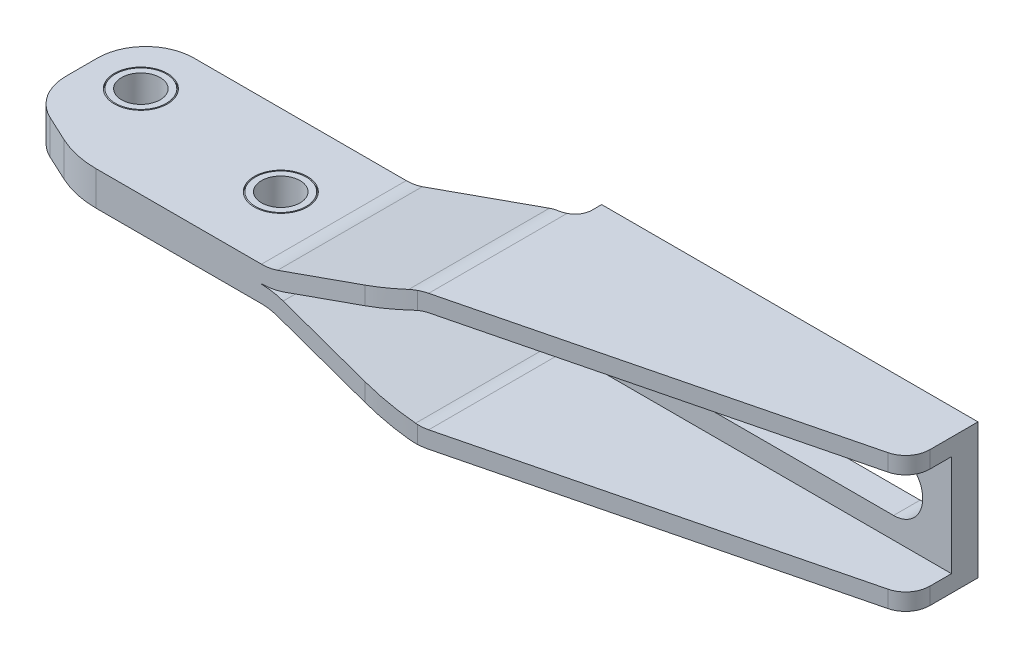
ISO-10303-21;
HEADER;
FILE_DESCRIPTION(('STEP AP214'),'2;1');
FILE_NAME('part.step','',(''),(''),'','','');
FILE_SCHEMA(('AUTOMOTIVE_DESIGN { 1 0 10303 214 1 1 1 1 }'));
ENDSEC;
DATA;
#1=APPLICATION_CONTEXT('core data for automotive mechanical design processes');
#2=APPLICATION_PROTOCOL_DEFINITION('international standard','automotive_design',2000,#1);
#3=PRODUCT_CONTEXT('',#1,'mechanical');
#4=PRODUCT('Part','Part','',(#3));
#5=PRODUCT_RELATED_PRODUCT_CATEGORY('part','',(#4));
#6=PRODUCT_DEFINITION_FORMATION('','',#4);
#7=PRODUCT_DEFINITION_CONTEXT('part definition',#1,'design');
#8=PRODUCT_DEFINITION('design','',#6,#7);
#9=PRODUCT_DEFINITION_SHAPE('','',#8);
#10=(LENGTH_UNIT() NAMED_UNIT(*) SI_UNIT(.MILLI.,.METRE.));
#11=(NAMED_UNIT(*) PLANE_ANGLE_UNIT() SI_UNIT($,.RADIAN.));
#12=(NAMED_UNIT(*) SI_UNIT($,.STERADIAN.) SOLID_ANGLE_UNIT());
#13=UNCERTAINTY_MEASURE_WITH_UNIT(LENGTH_MEASURE(1.E-05),#10,'distance_accuracy_value','');
#14=(GEOMETRIC_REPRESENTATION_CONTEXT(3) GLOBAL_UNCERTAINTY_ASSIGNED_CONTEXT((#13)) GLOBAL_UNIT_ASSIGNED_CONTEXT((#10,
#11,#12)) REPRESENTATION_CONTEXT('',''));
#15=CARTESIAN_POINT('',(0.,0.,0.));
#16=DIRECTION('',(0.,0.,1.));
#17=DIRECTION('',(1.,0.,0.));
#18=AXIS2_PLACEMENT_3D('',#15,#16,#17);
#19=CARTESIAN_POINT('',(0.,-3.65,0.));
#20=DIRECTION('',(0.,1.,0.));
#21=DIRECTION('',(1.,0.,0.));
#22=AXIS2_PLACEMENT_3D('',#19,#20,#21);
#23=CYLINDRICAL_SURFACE('',#22,4.);
#24=CARTESIAN_POINT('',(0.,-3.55,0.));
#25=DIRECTION('',(0.,1.,0.));
#26=DIRECTION('',(-1.,0.,0.));
#27=AXIS2_PLACEMENT_3D('',#24,#25,#26);
#28=CIRCLE('',#27,4.);
#29=CARTESIAN_POINT('',(-4.,-3.55,0.));
#30=VERTEX_POINT('',#29);
#31=EDGE_CURVE('E1807',#30,#30,#28,.F.);
#32=ORIENTED_EDGE('',*,*,#31,.T.);
#33=EDGE_LOOP('',(#32));
#34=FACE_BOUND('',#33,.T.);
#35=CARTESIAN_POINT('',(0.,3.55,0.));
#36=DIRECTION('',(0.,-1.,0.));
#37=DIRECTION('',(1.,0.,0.));
#38=AXIS2_PLACEMENT_3D('',#35,#36,#37);
#39=CIRCLE('',#38,4.);
#40=CARTESIAN_POINT('',(4.,3.55,0.));
#41=VERTEX_POINT('',#40);
#42=EDGE_CURVE('E1617',#41,#41,#39,.F.);
#43=ORIENTED_EDGE('',*,*,#42,.T.);
#44=EDGE_LOOP('',(#43));
#45=FACE_BOUND('',#44,.T.);
#46=ADVANCED_FACE('F14',(#34,#45),#23,.F.);
#47=CARTESIAN_POINT('',(0.,-3.65,0.));
#48=DIRECTION('',(0.,1.,0.));
#49=DIRECTION('',(1.,0.,0.));
#50=AXIS2_PLACEMENT_3D('',#47,#48,#49);
#51=CONICAL_SURFACE('',#50,5.2113248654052,0.523598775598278);
#52=CARTESIAN_POINT('',(0.,-3.55,0.));
#53=DIRECTION('',(0.,1.,0.));
#54=DIRECTION('',(-1.,0.,0.));
#55=AXIS2_PLACEMENT_3D('',#52,#53,#54);
#56=CIRCLE('',#55,5.26905989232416);
#57=CARTESIAN_POINT('',(-5.26905989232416,-3.55,0.));
#58=VERTEX_POINT('',#57);
#59=EDGE_CURVE('E1810',#58,#58,#56,.T.);
#60=ORIENTED_EDGE('',*,*,#59,.T.);
#61=EDGE_LOOP('',(#60));
#62=FACE_BOUND('',#61,.T.);
#63=CARTESIAN_POINT('',(0.,-3.15,0.));
#64=DIRECTION('',(0.,1.,0.));
#65=DIRECTION('',(1.,0.,0.));
#66=AXIS2_PLACEMENT_3D('',#63,#64,#65);
#67=CIRCLE('',#66,5.5);
#68=CARTESIAN_POINT('',(5.5,-3.15,0.));
#69=VERTEX_POINT('',#68);
#70=EDGE_CURVE('E9',#69,#69,#67,.T.);
#71=ORIENTED_EDGE('',*,*,#70,.F.);
#72=EDGE_LOOP('',(#71));
#73=FACE_BOUND('',#72,.T.);
#74=ADVANCED_FACE('F541',(#62,#73),#51,.T.);
#75=CARTESIAN_POINT('',(0.,3.15,0.));
#76=DIRECTION('',(0.,-1.,0.));
#77=DIRECTION('',(-1.,0.,0.));
#78=AXIS2_PLACEMENT_3D('',#75,#76,#77);
#79=CONICAL_SURFACE('',#78,5.5,0.523598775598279);
#80=CARTESIAN_POINT('',(0.,3.55,0.));
#81=DIRECTION('',(0.,-1.,0.));
#82=DIRECTION('',(1.,0.,0.));
#83=AXIS2_PLACEMENT_3D('',#80,#81,#82);
#84=CIRCLE('',#83,5.26905989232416);
#85=CARTESIAN_POINT('',(5.26905989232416,3.55,0.));
#86=VERTEX_POINT('',#85);
#87=EDGE_CURVE('E1798',#86,#86,#84,.T.);
#88=ORIENTED_EDGE('',*,*,#87,.T.);
#89=EDGE_LOOP('',(#88));
#90=FACE_BOUND('',#89,.T.);
#91=CARTESIAN_POINT('',(0.,3.15,0.));
#92=DIRECTION('',(0.,1.,0.));
#93=DIRECTION('',(1.,0.,0.));
#94=AXIS2_PLACEMENT_3D('',#91,#92,#93);
#95=CIRCLE('',#94,5.5);
#96=CARTESIAN_POINT('',(5.5,3.15,0.));
#97=VERTEX_POINT('',#96);
#98=EDGE_CURVE('E23',#97,#97,#95,.T.);
#99=ORIENTED_EDGE('',*,*,#98,.T.);
#100=EDGE_LOOP('',(#99));
#101=FACE_BOUND('',#100,.T.);
#102=ADVANCED_FACE('F533',(#90,#101),#79,.T.);
#103=CARTESIAN_POINT('',(33.,-3.65,4.));
#104=DIRECTION('',(0.,1.,0.));
#105=DIRECTION('',(1.,0.,0.));
#106=AXIS2_PLACEMENT_3D('',#103,#104,#105);
#107=CYLINDRICAL_SURFACE('',#106,4.);
#108=CARTESIAN_POINT('',(33.,-3.55,4.));
#109=DIRECTION('',(0.,1.,0.));
#110=DIRECTION('',(-1.,0.,0.));
#111=AXIS2_PLACEMENT_3D('',#108,#109,#110);
#112=CIRCLE('',#111,4.);
#113=CARTESIAN_POINT('',(29.,-3.55,4.));
#114=VERTEX_POINT('',#113);
#115=EDGE_CURVE('E1813',#114,#114,#112,.F.);
#116=ORIENTED_EDGE('',*,*,#115,.T.);
#117=EDGE_LOOP('',(#116));
#118=FACE_BOUND('',#117,.T.);
#119=CARTESIAN_POINT('',(33.,3.55,4.));
#120=DIRECTION('',(0.,-1.,0.));
#121=DIRECTION('',(1.,0.,0.));
#122=AXIS2_PLACEMENT_3D('',#119,#120,#121);
#123=CIRCLE('',#122,4.);
#124=CARTESIAN_POINT('',(37.,3.55,4.));
#125=VERTEX_POINT('',#124);
#126=EDGE_CURVE('E1801',#125,#125,#123,.F.);
#127=ORIENTED_EDGE('',*,*,#126,.T.);
#128=EDGE_LOOP('',(#127));
#129=FACE_BOUND('',#128,.T.);
#130=ADVANCED_FACE('F502',(#118,#129),#107,.F.);
#131=CARTESIAN_POINT('',(145.,0.,-16.5));
#132=DIRECTION('',(0.,0.,1.));
#133=DIRECTION('',(0.,1.,0.));
#134=AXIS2_PLACEMENT_3D('',#131,#132,#133);
#135=CYLINDRICAL_SURFACE('',#134,6.05);
#136=CARTESIAN_POINT('',(145.,0.,-11.));
#137=DIRECTION('',(0.,0.,1.));
#138=DIRECTION('',(-1.,0.,0.));
#139=AXIS2_PLACEMENT_3D('',#136,#137,#138);
#140=CIRCLE('',#139,6.05);
#141=CARTESIAN_POINT('',(145.,-6.05,-11.));
#142=VERTEX_POINT('',#141);
#143=CARTESIAN_POINT('',(145.,6.05,-11.));
#144=VERTEX_POINT('',#143);
#145=EDGE_CURVE('E1627',#142,#144,#140,.T.);
#146=ORIENTED_EDGE('',*,*,#145,.T.);
#147=DIRECTION('',(0.,0.,1.));
#148=VECTOR('',#147,1.);
#149=CARTESIAN_POINT('',(145.,6.05,-16.5));
#150=LINE('',#149,#148);
#151=CARTESIAN_POINT('',(145.,6.05,-16.5));
#152=VERTEX_POINT('',#151);
#153=EDGE_CURVE('E1654',#152,#144,#150,.T.);
#154=ORIENTED_EDGE('',*,*,#153,.F.);
#155=CARTESIAN_POINT('',(145.,0.,-16.5));
#156=DIRECTION('',(0.,0.,1.));
#157=DIRECTION('',(-1.,0.,0.));
#158=AXIS2_PLACEMENT_3D('',#155,#156,#157);
#159=CIRCLE('',#158,6.05);
#160=CARTESIAN_POINT('',(145.,-6.05,-16.5));
#161=VERTEX_POINT('',#160);
#162=EDGE_CURVE('E1640',#161,#152,#159,.T.);
#163=ORIENTED_EDGE('',*,*,#162,.F.);
#164=DIRECTION('',(0.,0.,1.));
#165=VECTOR('',#164,1.);
#166=CARTESIAN_POINT('',(145.,-6.05,-16.5));
#167=LINE('',#166,#165);
#168=EDGE_CURVE('E1656',#161,#142,#167,.T.);
#169=ORIENTED_EDGE('',*,*,#168,.T.);
#170=EDGE_LOOP('',(#146,#154,#163,#169));
#171=FACE_BOUND('',#170,.T.);
#172=ADVANCED_FACE('F498',(#171),#135,.F.);
#173=CARTESIAN_POINT('',(145.,6.05,-16.5));
#174=DIRECTION('',(0.,1.,0.));
#175=DIRECTION('',(-1.,0.,0.));
#176=AXIS2_PLACEMENT_3D('',#173,#174,#175);
#177=PLANE('',#176);
#178=DIRECTION('',(-1.,0.,0.));
#179=VECTOR('',#178,1.);
#180=CARTESIAN_POINT('',(145.,6.05,-11.));
#181=LINE('',#180,#179);
#182=CARTESIAN_POINT('',(91.,6.05,-11.));
#183=VERTEX_POINT('',#182);
#184=EDGE_CURVE('E39',#144,#183,#181,.T.);
#185=ORIENTED_EDGE('',*,*,#184,.T.);
#186=DIRECTION('',(0.,0.,1.));
#187=VECTOR('',#186,1.);
#188=CARTESIAN_POINT('',(91.,6.05,-16.5));
#189=LINE('',#188,#187);
#190=CARTESIAN_POINT('',(91.,6.05,-16.5));
#191=VERTEX_POINT('',#190);
#192=EDGE_CURVE('E1652',#191,#183,#189,.T.);
#193=ORIENTED_EDGE('',*,*,#192,.F.);
#194=DIRECTION('',(-1.,0.,0.));
#195=VECTOR('',#194,1.);
#196=CARTESIAN_POINT('',(145.,6.05,-16.5));
#197=LINE('',#196,#195);
#198=EDGE_CURVE('E1643',#152,#191,#197,.T.);
#199=ORIENTED_EDGE('',*,*,#198,.F.);
#200=ORIENTED_EDGE('',*,*,#153,.T.);
#201=EDGE_LOOP('',(#185,#193,#199,#200));
#202=FACE_BOUND('',#201,.T.);
#203=ADVANCED_FACE('F501',(#202),#177,.F.);
#204=CARTESIAN_POINT('',(91.,0.,-16.5));
#205=DIRECTION('',(0.,0.,1.));
#206=DIRECTION('',(0.,1.,0.));
#207=AXIS2_PLACEMENT_3D('',#204,#205,#206);
#208=CYLINDRICAL_SURFACE('',#207,6.05);
#209=CARTESIAN_POINT('',(91.,0.,-11.));
#210=DIRECTION('',(0.,0.,1.));
#211=DIRECTION('',(1.,0.,0.));
#212=AXIS2_PLACEMENT_3D('',#209,#210,#211);
#213=CIRCLE('',#212,6.05);
#214=CARTESIAN_POINT('',(91.,-6.05,-11.));
#215=VERTEX_POINT('',#214);
#216=EDGE_CURVE('E1633',#183,#215,#213,.T.);
#217=ORIENTED_EDGE('',*,*,#216,.T.);
#218=DIRECTION('',(0.,0.,1.));
#219=VECTOR('',#218,1.);
#220=CARTESIAN_POINT('',(91.,-6.05,-16.5));
#221=LINE('',#220,#219);
#222=CARTESIAN_POINT('',(91.,-6.05,-16.5));
#223=VERTEX_POINT('',#222);
#224=EDGE_CURVE('E1649',#223,#215,#221,.T.);
#225=ORIENTED_EDGE('',*,*,#224,.F.);
#226=CARTESIAN_POINT('',(91.,0.,-16.5));
#227=DIRECTION('',(0.,0.,1.));
#228=DIRECTION('',(1.,0.,0.));
#229=AXIS2_PLACEMENT_3D('',#226,#227,#228);
#230=CIRCLE('',#229,6.05);
#231=EDGE_CURVE('E1646',#191,#223,#230,.T.);
#232=ORIENTED_EDGE('',*,*,#231,.F.);
#233=ORIENTED_EDGE('',*,*,#192,.T.);
#234=EDGE_LOOP('',(#217,#225,#232,#233));
#235=FACE_BOUND('',#234,.T.);
#236=ADVANCED_FACE('F497',(#235),#208,.F.);
#237=CARTESIAN_POINT('',(91.,-6.05,-16.5));
#238=DIRECTION('',(0.,-1.,0.));
#239=DIRECTION('',(1.,0.,0.));
#240=AXIS2_PLACEMENT_3D('',#237,#238,#239);
#241=PLANE('',#240);
#242=DIRECTION('',(1.,0.,0.));
#243=VECTOR('',#242,1.);
#244=CARTESIAN_POINT('',(91.,-6.05,-11.));
#245=LINE('',#244,#243);
#246=EDGE_CURVE('E1626',#215,#142,#245,.T.);
#247=ORIENTED_EDGE('',*,*,#246,.T.);
#248=ORIENTED_EDGE('',*,*,#168,.F.);
#249=DIRECTION('',(1.,0.,0.));
#250=VECTOR('',#249,1.);
#251=CARTESIAN_POINT('',(91.,-6.05,-16.5));
#252=LINE('',#251,#250);
#253=EDGE_CURVE('E31',#223,#161,#252,.T.);
#254=ORIENTED_EDGE('',*,*,#253,.F.);
#255=ORIENTED_EDGE('',*,*,#224,.T.);
#256=EDGE_LOOP('',(#247,#248,#254,#255));
#257=FACE_BOUND('',#256,.T.);
#258=ADVANCED_FACE('F389',(#257),#241,.F.);
#259=CARTESIAN_POINT('',(151.999999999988,-14.,-6.5000000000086));
#260=DIRECTION('',(0.,1.,0.));
#261=DIRECTION('',(-1.,0.,0.));
#262=AXIS2_PLACEMENT_3D('',#259,#260,#261);
#263=CYLINDRICAL_SURFACE('',#262,5.00000000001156);
#264=DIRECTION('',(0.,1.,0.));
#265=VECTOR('',#264,1.);
#266=CARTESIAN_POINT('',(153.209609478,-14.,-1.64852136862));
#267=LINE('',#266,#265);
#268=CARTESIAN_POINT('',(153.209609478,10.5,-1.64852136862));
#269=VERTEX_POINT('',#268);
#270=CARTESIAN_POINT('',(153.209609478,14.,-1.64852136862));
#271=VERTEX_POINT('',#270);
#272=EDGE_CURVE('E1529',#269,#271,#267,.T.);
#273=ORIENTED_EDGE('',*,*,#272,.F.);
#274=CARTESIAN_POINT('',(151.999999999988,10.5,-6.5000000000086));
#275=DIRECTION('',(0.,-1.,0.));
#276=DIRECTION('',(1.,0.,0.));
#277=AXIS2_PLACEMENT_3D('',#274,#275,#276);
#278=CIRCLE('',#277,5.00000000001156);
#279=CARTESIAN_POINT('',(157.,10.5,-6.5));
#280=VERTEX_POINT('',#279);
#281=EDGE_CURVE('E1579',#269,#280,#278,.F.);
#282=ORIENTED_EDGE('',*,*,#281,.T.);
#283=DIRECTION('',(0.,1.,0.));
#284=VECTOR('',#283,1.);
#285=CARTESIAN_POINT('',(157.,-14.,-6.5));
#286=LINE('',#285,#284);
#287=CARTESIAN_POINT('',(157.,14.,-6.5));
#288=VERTEX_POINT('',#287);
#289=EDGE_CURVE('E1523',#280,#288,#286,.T.);
#290=ORIENTED_EDGE('',*,*,#289,.T.);
#291=CARTESIAN_POINT('',(151.999999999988,14.,-6.5000000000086));
#292=DIRECTION('',(0.,1.,0.));
#293=DIRECTION('',(-1.,0.,0.));
#294=AXIS2_PLACEMENT_3D('',#291,#292,#293);
#295=CIRCLE('',#294,5.00000000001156);
#296=EDGE_CURVE('E1504',#271,#288,#295,.T.);
#297=ORIENTED_EDGE('',*,*,#296,.F.);
#298=EDGE_LOOP('',(#273,#282,#290,#297));
#299=FACE_BOUND('',#298,.T.);
#300=ADVANCED_FACE('F461',(#299),#263,.T.);
#301=CARTESIAN_POINT('',(157.,-14.,-16.5));
#302=DIRECTION('',(0.,0.,-1.));
#303=DIRECTION('',(0.,-1.,0.));
#304=AXIS2_PLACEMENT_3D('',#301,#302,#303);
#305=PLANE('',#304);
#306=ORIENTED_EDGE('',*,*,#253,.T.);
#307=ORIENTED_EDGE('',*,*,#162,.T.);
#308=ORIENTED_EDGE('',*,*,#198,.T.);
#309=ORIENTED_EDGE('',*,*,#231,.T.);
#310=EDGE_LOOP('',(#306,#307,#308,#309));
#311=FACE_BOUND('',#310,.T.);
#312=DIRECTION('',(0.,1.,0.));
#313=VECTOR('',#312,1.);
#314=CARTESIAN_POINT('',(79.,-14.,-16.5));
#315=LINE('',#314,#313);
#316=CARTESIAN_POINT('',(79.,-14.,-16.5));
#317=VERTEX_POINT('',#316);
#318=CARTESIAN_POINT('',(79.,14.,-16.5));
#319=VERTEX_POINT('',#318);
#320=EDGE_CURVE('E1559',#317,#319,#315,.T.);
#321=ORIENTED_EDGE('',*,*,#320,.T.);
#322=DIRECTION('',(-1.,0.,0.));
#323=VECTOR('',#322,1.);
#324=CARTESIAN_POINT('',(157.,14.,-16.5));
#325=LINE('',#324,#323);
#326=CARTESIAN_POINT('',(157.,14.,-16.5));
#327=VERTEX_POINT('',#326);
#328=EDGE_CURVE('E1492',#327,#319,#325,.T.);
#329=ORIENTED_EDGE('',*,*,#328,.F.);
#330=DIRECTION('',(0.,1.,0.));
#331=VECTOR('',#330,1.);
#332=CARTESIAN_POINT('',(157.,-14.,-16.5));
#333=LINE('',#332,#331);
#334=CARTESIAN_POINT('',(157.,-14.,-16.5));
#335=VERTEX_POINT('',#334);
#336=EDGE_CURVE('E1561',#335,#327,#333,.T.);
#337=ORIENTED_EDGE('',*,*,#336,.F.);
#338=DIRECTION('',(-1.,0.,0.));
#339=VECTOR('',#338,1.);
#340=CARTESIAN_POINT('',(157.,-14.,-16.5));
#341=LINE('',#340,#339);
#342=EDGE_CURVE('E1510',#335,#317,#341,.T.);
#343=ORIENTED_EDGE('',*,*,#342,.T.);
#344=EDGE_LOOP('',(#321,#329,#337,#343));
#345=FACE_BOUND('',#344,.T.);
#346=ADVANCED_FACE('F809',(#311,#345),#305,.T.);
#347=CARTESIAN_POINT('',(76.9999999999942,4.000000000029,-11.));
#348=DIRECTION('',(0.,0.,1.));
#349=DIRECTION('',(0.,1.,0.));
#350=AXIS2_PLACEMENT_3D('',#347,#348,#349);
#351=PLANE('',#350);
#352=ORIENTED_EDGE('',*,*,#246,.F.);
#353=ORIENTED_EDGE('',*,*,#216,.F.);
#354=ORIENTED_EDGE('',*,*,#184,.F.);
#355=ORIENTED_EDGE('',*,*,#145,.F.);
#356=EDGE_LOOP('',(#352,#353,#354,#355));
#357=FACE_BOUND('',#356,.T.);
#358=DIRECTION('',(0.,1.,0.));
#359=VECTOR('',#358,1.);
#360=CARTESIAN_POINT('',(79.,-10.5,-11.));
#361=LINE('',#360,#359);
#362=CARTESIAN_POINT('',(79.,-10.5,-11.));
#363=VERTEX_POINT('',#362);
#364=CARTESIAN_POINT('',(79.,10.5,-11.));
#365=VERTEX_POINT('',#364);
#366=EDGE_CURVE('E1658',#363,#365,#361,.T.);
#367=ORIENTED_EDGE('',*,*,#366,.F.);
#368=DIRECTION('',(1.,0.,0.));
#369=VECTOR('',#368,1.);
#370=CARTESIAN_POINT('',(77.,-10.5,-11.));
#371=LINE('',#370,#369);
#372=CARTESIAN_POINT('',(157.,-10.5,-11.));
#373=VERTEX_POINT('',#372);
#374=EDGE_CURVE('E333',#363,#373,#371,.T.);
#375=ORIENTED_EDGE('',*,*,#374,.T.);
#376=DIRECTION('',(0.,-1.,0.));
#377=VECTOR('',#376,1.);
#378=CARTESIAN_POINT('',(157.,-14.,-11.));
#379=LINE('',#378,#377);
#380=CARTESIAN_POINT('',(157.,10.5,-11.));
#381=VERTEX_POINT('',#380);
#382=EDGE_CURVE('E1585',#381,#373,#379,.T.);
#383=ORIENTED_EDGE('',*,*,#382,.F.);
#384=DIRECTION('',(-1.,0.,0.));
#385=VECTOR('',#384,1.);
#386=CARTESIAN_POINT('',(162.,10.5,-11.));
#387=LINE('',#386,#385);
#388=EDGE_CURVE('E336',#381,#365,#387,.T.);
#389=ORIENTED_EDGE('',*,*,#388,.T.);
#390=EDGE_LOOP('',(#367,#375,#383,#389));
#391=FACE_BOUND('',#390,.T.);
#392=ADVANCED_FACE('F390',(#357,#391),#351,.T.);
#393=CARTESIAN_POINT('',(157.,-14.,-6.5));
#394=DIRECTION('',(1.,0.,0.));
#395=DIRECTION('',(0.,1.,0.));
#396=AXIS2_PLACEMENT_3D('',#393,#394,#395);
#397=PLANE('',#396);
#398=ORIENTED_EDGE('',*,*,#382,.T.);
#399=DIRECTION('',(0.,0.,1.));
#400=VECTOR('',#399,1.);
#401=CARTESIAN_POINT('',(157.,-10.5,-6.5));
#402=LINE('',#401,#400);
#403=CARTESIAN_POINT('',(157.,-10.5,-6.5));
#404=VERTEX_POINT('',#403);
#405=EDGE_CURVE('E355',#373,#404,#402,.T.);
#406=ORIENTED_EDGE('',*,*,#405,.T.);
#407=CARTESIAN_POINT('',(157.,-14.,-6.5));
#408=VERTEX_POINT('',#407);
#409=EDGE_CURVE('E1526',#408,#404,#286,.T.);
#410=ORIENTED_EDGE('',*,*,#409,.F.);
#411=DIRECTION('',(0.,0.,-1.));
#412=VECTOR('',#411,1.);
#413=CARTESIAN_POINT('',(157.,-14.,-6.5));
#414=LINE('',#413,#412);
#415=EDGE_CURVE('E1507',#408,#335,#414,.T.);
#416=ORIENTED_EDGE('',*,*,#415,.T.);
#417=ORIENTED_EDGE('',*,*,#336,.T.);
#418=DIRECTION('',(0.,0.,-1.));
#419=VECTOR('',#418,1.);
#420=CARTESIAN_POINT('',(157.,14.,-6.5));
#421=LINE('',#420,#419);
#422=EDGE_CURVE('E1491',#288,#327,#421,.T.);
#423=ORIENTED_EDGE('',*,*,#422,.F.);
#424=ORIENTED_EDGE('',*,*,#289,.F.);
#425=DIRECTION('',(0.,0.,-1.));
#426=VECTOR('',#425,1.);
#427=CARTESIAN_POINT('',(157.,10.5,-6.5));
#428=LINE('',#427,#426);
#429=EDGE_CURVE('E349',#280,#381,#428,.T.);
#430=ORIENTED_EDGE('',*,*,#429,.T.);
#431=EDGE_LOOP('',(#398,#406,#410,#416,#417,#423,#424,#430));
#432=FACE_BOUND('',#431,.T.);
#433=ADVANCED_FACE('F16',(#432),#397,.T.);
#434=ORIENTED_EDGE('',*,*,#409,.T.);
#435=CARTESIAN_POINT('',(151.999999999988,-10.5,-6.5000000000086));
#436=DIRECTION('',(0.,1.,0.));
#437=DIRECTION('',(-1.,0.,0.));
#438=AXIS2_PLACEMENT_3D('',#435,#436,#437);
#439=CIRCLE('',#438,5.00000000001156);
#440=CARTESIAN_POINT('',(153.209609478,-10.5,-1.64852136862));
#441=VERTEX_POINT('',#440);
#442=EDGE_CURVE('E1582',#404,#441,#439,.F.);
#443=ORIENTED_EDGE('',*,*,#442,.T.);
#444=CARTESIAN_POINT('',(153.209609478,-14.,-1.64852136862));
#445=VERTEX_POINT('',#444);
#446=EDGE_CURVE('E1530',#445,#441,#267,.T.);
#447=ORIENTED_EDGE('',*,*,#446,.F.);
#448=CARTESIAN_POINT('',(151.999999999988,-14.,-6.5000000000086));
#449=DIRECTION('',(0.,1.,0.));
#450=DIRECTION('',(-1.,0.,0.));
#451=AXIS2_PLACEMENT_3D('',#448,#449,#450);
#452=CIRCLE('',#451,5.00000000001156);
#453=EDGE_CURVE('E1520',#445,#408,#452,.T.);
#454=ORIENTED_EDGE('',*,*,#453,.T.);
#455=EDGE_LOOP('',(#434,#443,#447,#454));
#456=FACE_BOUND('',#455,.T.);
#457=ADVANCED_FACE('F529',(#456),#263,.T.);
#458=CARTESIAN_POINT('',(33.,3.15,4.));
#459=DIRECTION('',(0.,-1.,0.));
#460=DIRECTION('',(-1.,0.,0.));
#461=AXIS2_PLACEMENT_3D('',#458,#459,#460);
#462=CONICAL_SURFACE('',#461,5.5,0.523598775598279);
#463=CARTESIAN_POINT('',(33.,3.55,4.));
#464=DIRECTION('',(0.,-1.,0.));
#465=DIRECTION('',(1.,0.,0.));
#466=AXIS2_PLACEMENT_3D('',#463,#464,#465);
#467=CIRCLE('',#466,5.26905989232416);
#468=CARTESIAN_POINT('',(38.2690598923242,3.55,4.));
#469=VERTEX_POINT('',#468);
#470=EDGE_CURVE('E1804',#469,#469,#467,.T.);
#471=ORIENTED_EDGE('',*,*,#470,.T.);
#472=EDGE_LOOP('',(#471));
#473=FACE_BOUND('',#472,.T.);
#474=CARTESIAN_POINT('',(33.,3.15,4.));
#475=DIRECTION('',(0.,1.,0.));
#476=DIRECTION('',(1.,0.,0.));
#477=AXIS2_PLACEMENT_3D('',#474,#475,#476);
#478=CIRCLE('',#477,5.5);
#479=CARTESIAN_POINT('',(38.5,3.15,4.));
#480=VERTEX_POINT('',#479);
#481=EDGE_CURVE('E1602',#480,#480,#478,.T.);
#482=ORIENTED_EDGE('',*,*,#481,.T.);
#483=EDGE_LOOP('',(#482));
#484=FACE_BOUND('',#483,.T.);
#485=ADVANCED_FACE('F525',(#473,#484),#462,.T.);
#486=CARTESIAN_POINT('',(75.1584070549,-14.,17.81182905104));
#487=DIRECTION('',(0.241921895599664,0.,0.970295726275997));
#488=DIRECTION('',(0.970295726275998,0.,-0.241921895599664));
#489=AXIS2_PLACEMENT_3D('',#486,#487,#488);
#490=PLANE('',#489);
#491=CARTESIAN_POINT('',(76.9999999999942,4.000000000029,17.3526683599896));
#492=DIRECTION('',(0.241921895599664,0.,0.970295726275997));
#493=DIRECTION('',(0.970295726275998,0.,-0.241921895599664));
#494=AXIS2_PLACEMENT_3D('',#491,#492,#493);
#495=ELLIPSE('',#494,6.69898859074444,6.499999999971);
#496=CARTESIAN_POINT('',(75.1584070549,10.2336614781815,17.81182905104));
#497=VERTEX_POINT('',#496);
#498=CARTESIAN_POINT('',(77.,10.5,17.3526683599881));
#499=VERTEX_POINT('',#498);
#500=EDGE_CURVE('E1591',#497,#499,#495,.F.);
#501=ORIENTED_EDGE('',*,*,#500,.T.);
#502=DIRECTION('',(0.970295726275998,0.,-0.241921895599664));
#503=VECTOR('',#502,1.);
#504=CARTESIAN_POINT('',(75.1584070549,10.5,17.81182905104));
#505=LINE('',#504,#503);
#506=EDGE_CURVE('E352',#499,#269,#505,.T.);
#507=ORIENTED_EDGE('',*,*,#506,.T.);
#508=ORIENTED_EDGE('',*,*,#272,.T.);
#509=DIRECTION('',(0.970295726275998,0.,-0.241921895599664));
#510=VECTOR('',#509,1.);
#511=CARTESIAN_POINT('',(75.1584070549,14.,17.81182905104));
#512=LINE('',#511,#510);
#513=CARTESIAN_POINT('',(77.000000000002,14.,17.3526683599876));
#514=VERTEX_POINT('',#513);
#515=EDGE_CURVE('E1501',#514,#271,#512,.T.);
#516=ORIENTED_EDGE('',*,*,#515,.F.);
#517=CARTESIAN_POINT('',(77.000000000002,3.99999999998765,17.3526683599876));
#518=DIRECTION('',(0.241921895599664,0.,0.970295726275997));
#519=DIRECTION('',(0.970295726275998,0.,-0.241921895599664));
#520=AXIS2_PLACEMENT_3D('',#517,#518,#519);
#521=ELLIPSE('',#520,10.3061362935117,10.0000000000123);
#522=CARTESIAN_POINT('',(75.1584070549,13.8289641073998,17.81182905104));
#523=VERTEX_POINT('',#522);
#524=EDGE_CURVE('E1708',#514,#523,#521,.T.);
#525=ORIENTED_EDGE('',*,*,#524,.T.);
#526=DIRECTION('',(0.,1.,0.));
#527=VECTOR('',#526,1.);
#528=CARTESIAN_POINT('',(75.1584070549,-14.,17.81182905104));
#529=LINE('',#528,#527);
#530=EDGE_CURVE('E1533',#497,#523,#529,.T.);
#531=ORIENTED_EDGE('',*,*,#530,.F.);
#532=EDGE_LOOP('',(#501,#507,#508,#516,#525,#531));
#533=FACE_BOUND('',#532,.T.);
#534=ADVANCED_FACE('F528',(#533),#490,.T.);
#535=CARTESIAN_POINT('',(75.5,14.,-14.4999999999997));
#536=DIRECTION('',(0.,-1.,0.));
#537=DIRECTION('',(1.,0.,0.));
#538=AXIS2_PLACEMENT_3D('',#535,#536,#537);
#539=PLANE('',#538);
#540=DIRECTION('',(0.,0.,-1.));
#541=VECTOR('',#540,1.);
#542=CARTESIAN_POINT('',(77.,14.,21.));
#543=LINE('',#542,#541);
#544=CARTESIAN_POINT('',(77.,14.,-11.3377223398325));
#545=VERTEX_POINT('',#544);
#546=EDGE_CURVE('E1705',#514,#545,#543,.T.);
#547=ORIENTED_EDGE('',*,*,#546,.F.);
#548=ORIENTED_EDGE('',*,*,#515,.T.);
#549=ORIENTED_EDGE('',*,*,#296,.T.);
#550=ORIENTED_EDGE('',*,*,#422,.T.);
#551=ORIENTED_EDGE('',*,*,#328,.T.);
#552=DIRECTION('',(0.,0.,1.));
#553=VECTOR('',#552,1.);
#554=CARTESIAN_POINT('',(79.,14.,-16.5));
#555=LINE('',#554,#553);
#556=CARTESIAN_POINT('',(79.,14.,-14.5));
#557=VERTEX_POINT('',#556);
#558=EDGE_CURVE('E1495',#319,#557,#555,.T.);
#559=ORIENTED_EDGE('',*,*,#558,.T.);
#560=CARTESIAN_POINT('',(75.5,14.,-14.4999999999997));
#561=DIRECTION('',(0.,-1.,0.));
#562=DIRECTION('',(-1.,0.,0.));
#563=AXIS2_PLACEMENT_3D('',#560,#561,#562);
#564=CIRCLE('',#563,3.49999999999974);
#565=EDGE_CURVE('E1498',#557,#545,#564,.T.);
#566=ORIENTED_EDGE('',*,*,#565,.T.);
#567=EDGE_LOOP('',(#547,#548,#549,#550,#551,#559,#566));
#568=FACE_BOUND('',#567,.T.);
#569=ADVANCED_FACE('F419',(#568),#539,.F.);
#570=CARTESIAN_POINT('',(162.,10.5,29.));
#571=DIRECTION('',(0.,-1.,0.));
#572=DIRECTION('',(1.,0.,0.));
#573=AXIS2_PLACEMENT_3D('',#570,#571,#572);
#574=PLANE('',#573);
#575=DIRECTION('',(0.,0.,-1.));
#576=VECTOR('',#575,1.);
#577=CARTESIAN_POINT('',(77.,10.5,29.));
#578=LINE('',#577,#576);
#579=CARTESIAN_POINT('',(77.,10.5,-11.3377223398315));
#580=VERTEX_POINT('',#579);
#581=EDGE_CURVE('E347',#499,#580,#578,.T.);
#582=ORIENTED_EDGE('',*,*,#581,.T.);
#583=CARTESIAN_POINT('',(75.5,10.5,-14.4999999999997));
#584=DIRECTION('',(0.,1.,0.));
#585=DIRECTION('',(-1.,0.,0.));
#586=AXIS2_PLACEMENT_3D('',#583,#584,#585);
#587=CIRCLE('',#586,3.49999999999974);
#588=CARTESIAN_POINT('',(79.,10.5,-14.5));
#589=VERTEX_POINT('',#588);
#590=EDGE_CURVE('E1678',#580,#589,#587,.T.);
#591=ORIENTED_EDGE('',*,*,#590,.T.);
#592=DIRECTION('',(0.,0.,1.));
#593=VECTOR('',#592,1.);
#594=CARTESIAN_POINT('',(79.,10.5,-27.5));
#595=LINE('',#594,#593);
#596=EDGE_CURVE('E1661',#589,#365,#595,.T.);
#597=ORIENTED_EDGE('',*,*,#596,.T.);
#598=ORIENTED_EDGE('',*,*,#388,.F.);
#599=ORIENTED_EDGE('',*,*,#429,.F.);
#600=ORIENTED_EDGE('',*,*,#281,.F.);
#601=ORIENTED_EDGE('',*,*,#506,.F.);
#602=EDGE_LOOP('',(#582,#591,#597,#598,#599,#600,#601));
#603=FACE_BOUND('',#602,.T.);
#604=ADVANCED_FACE('F415',(#603),#574,.T.);
#605=CARTESIAN_POINT('',(33.,-3.65,4.));
#606=DIRECTION('',(0.,1.,0.));
#607=DIRECTION('',(1.,0.,0.));
#608=AXIS2_PLACEMENT_3D('',#605,#606,#607);
#609=CONICAL_SURFACE('',#608,5.2113248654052,0.523598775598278);
#610=CARTESIAN_POINT('',(33.,-3.55,4.));
#611=DIRECTION('',(0.,1.,0.));
#612=DIRECTION('',(-1.,0.,0.));
#613=AXIS2_PLACEMENT_3D('',#610,#611,#612);
#614=CIRCLE('',#613,5.26905989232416);
#615=CARTESIAN_POINT('',(27.7309401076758,-3.55,4.));
#616=VERTEX_POINT('',#615);
#617=EDGE_CURVE('E295',#616,#616,#614,.T.);
#618=ORIENTED_EDGE('',*,*,#617,.T.);
#619=EDGE_LOOP('',(#618));
#620=FACE_BOUND('',#619,.T.);
#621=CARTESIAN_POINT('',(33.,-3.15,4.));
#622=DIRECTION('',(0.,1.,0.));
#623=DIRECTION('',(1.,0.,0.));
#624=AXIS2_PLACEMENT_3D('',#621,#622,#623);
#625=CIRCLE('',#624,5.5);
#626=CARTESIAN_POINT('',(38.5,-3.15,4.));
#627=VERTEX_POINT('',#626);
#628=EDGE_CURVE('E1605',#627,#627,#625,.T.);
#629=ORIENTED_EDGE('',*,*,#628,.F.);
#630=EDGE_LOOP('',(#629));
#631=FACE_BOUND('',#630,.T.);
#632=ADVANCED_FACE('F418',(#620,#631),#609,.T.);
#633=CARTESIAN_POINT('',(75.5,-14.,-14.4999999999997));
#634=DIRECTION('',(0.,-1.,0.));
#635=DIRECTION('',(1.,0.,0.));
#636=AXIS2_PLACEMENT_3D('',#633,#634,#635);
#637=PLANE('',#636);
#638=DIRECTION('',(0.970295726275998,0.,-0.241921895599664));
#639=VECTOR('',#638,1.);
#640=CARTESIAN_POINT('',(75.1584070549,-14.,17.81182905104));
#641=LINE('',#640,#639);
#642=CARTESIAN_POINT('',(77.,-14.,17.3526683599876));
#643=VERTEX_POINT('',#642);
#644=EDGE_CURVE('E1518',#643,#445,#641,.T.);
#645=ORIENTED_EDGE('',*,*,#644,.F.);
#646=DIRECTION('',(0.,0.,-1.));
#647=VECTOR('',#646,1.);
#648=CARTESIAN_POINT('',(77.,-14.,21.));
#649=LINE('',#648,#647);
#650=CARTESIAN_POINT('',(77.000000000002,-14.,-11.3377223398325));
#651=VERTEX_POINT('',#650);
#652=EDGE_CURVE('E1695',#643,#651,#649,.T.);
#653=ORIENTED_EDGE('',*,*,#652,.T.);
#654=CARTESIAN_POINT('',(75.5,-14.,-14.4999999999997));
#655=DIRECTION('',(0.,-1.,0.));
#656=DIRECTION('',(-1.,0.,0.));
#657=AXIS2_PLACEMENT_3D('',#654,#655,#656);
#658=CIRCLE('',#657,3.49999999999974);
#659=CARTESIAN_POINT('',(79.,-14.,-14.5));
#660=VERTEX_POINT('',#659);
#661=EDGE_CURVE('E1516',#660,#651,#658,.T.);
#662=ORIENTED_EDGE('',*,*,#661,.F.);
#663=DIRECTION('',(0.,0.,1.));
#664=VECTOR('',#663,1.);
#665=CARTESIAN_POINT('',(79.,-14.,-16.5));
#666=LINE('',#665,#664);
#667=EDGE_CURVE('E1513',#317,#660,#666,.T.);
#668=ORIENTED_EDGE('',*,*,#667,.F.);
#669=ORIENTED_EDGE('',*,*,#342,.F.);
#670=ORIENTED_EDGE('',*,*,#415,.F.);
#671=ORIENTED_EDGE('',*,*,#453,.F.);
#672=EDGE_LOOP('',(#645,#653,#662,#668,#669,#670,#671));
#673=FACE_BOUND('',#672,.T.);
#674=ADVANCED_FACE('F537',(#673),#637,.T.);
#675=CARTESIAN_POINT('',(79.,-14.,-16.5));
#676=DIRECTION('',(-1.,0.,0.));
#677=DIRECTION('',(0.,-1.,0.));
#678=AXIS2_PLACEMENT_3D('',#675,#676,#677);
#679=PLANE('',#678);
#680=ORIENTED_EDGE('',*,*,#558,.F.);
#681=ORIENTED_EDGE('',*,*,#320,.F.);
#682=ORIENTED_EDGE('',*,*,#667,.T.);
#683=DIRECTION('',(0.,1.,0.));
#684=VECTOR('',#683,1.);
#685=CARTESIAN_POINT('',(79.,-14.,-14.5));
#686=LINE('',#685,#684);
#687=CARTESIAN_POINT('',(79.,-10.5,-14.5));
#688=VERTEX_POINT('',#687);
#689=EDGE_CURVE('E1556',#660,#688,#686,.T.);
#690=ORIENTED_EDGE('',*,*,#689,.T.);
#691=DIRECTION('',(0.,0.,1.));
#692=VECTOR('',#691,1.);
#693=CARTESIAN_POINT('',(79.,-10.5,-27.5));
#694=LINE('',#693,#692);
#695=EDGE_CURVE('E485',#688,#363,#694,.T.);
#696=ORIENTED_EDGE('',*,*,#695,.T.);
#697=ORIENTED_EDGE('',*,*,#366,.T.);
#698=ORIENTED_EDGE('',*,*,#596,.F.);
#699=EDGE_CURVE('E1555',#589,#557,#686,.T.);
#700=ORIENTED_EDGE('',*,*,#699,.T.);
#701=EDGE_LOOP('',(#680,#681,#682,#690,#696,#697,#698,#700));
#702=FACE_BOUND('',#701,.T.);
#703=ADVANCED_FACE('F425',(#702),#679,.T.);
#704=CARTESIAN_POINT('',(77.,-10.5,29.));
#705=DIRECTION('',(0.,1.,0.));
#706=DIRECTION('',(-1.,0.,0.));
#707=AXIS2_PLACEMENT_3D('',#704,#705,#706);
#708=PLANE('',#707);
#709=ORIENTED_EDGE('',*,*,#442,.F.);
#710=ORIENTED_EDGE('',*,*,#405,.F.);
#711=ORIENTED_EDGE('',*,*,#374,.F.);
#712=ORIENTED_EDGE('',*,*,#695,.F.);
#713=CARTESIAN_POINT('',(75.5,-10.5,-14.4999999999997));
#714=DIRECTION('',(0.,-1.,0.));
#715=DIRECTION('',(1.,0.,0.));
#716=AXIS2_PLACEMENT_3D('',#713,#714,#715);
#717=CIRCLE('',#716,3.49999999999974);
#718=CARTESIAN_POINT('',(77.,-10.5,-11.3377223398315));
#719=VERTEX_POINT('',#718);
#720=EDGE_CURVE('E337',#688,#719,#717,.T.);
#721=ORIENTED_EDGE('',*,*,#720,.T.);
#722=DIRECTION('',(0.,0.,-1.));
#723=VECTOR('',#722,1.);
#724=CARTESIAN_POINT('',(77.,-10.5,29.));
#725=LINE('',#724,#723);
#726=CARTESIAN_POINT('',(77.,-10.5,17.3526683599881));
#727=VERTEX_POINT('',#726);
#728=EDGE_CURVE('E332',#727,#719,#725,.T.);
#729=ORIENTED_EDGE('',*,*,#728,.F.);
#730=DIRECTION('',(-0.970295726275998,0.,0.241921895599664));
#731=VECTOR('',#730,1.);
#732=CARTESIAN_POINT('',(75.1584070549,-10.5,17.81182905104));
#733=LINE('',#732,#731);
#734=EDGE_CURVE('E358',#441,#727,#733,.T.);
#735=ORIENTED_EDGE('',*,*,#734,.F.);
#736=EDGE_LOOP('',(#709,#710,#711,#712,#721,#729,#735));
#737=FACE_BOUND('',#736,.T.);
#738=ADVANCED_FACE('F421',(#737),#708,.T.);
#739=ORIENTED_EDGE('',*,*,#446,.T.);
#740=ORIENTED_EDGE('',*,*,#734,.T.);
#741=CARTESIAN_POINT('',(76.9999999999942,-4.000000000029,17.3526683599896));
#742=DIRECTION('',(0.241921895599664,0.,0.970295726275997));
#743=DIRECTION('',(0.970295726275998,0.,-0.241921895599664));
#744=AXIS2_PLACEMENT_3D('',#741,#742,#743);
#745=ELLIPSE('',#744,6.69898859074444,6.499999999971);
#746=CARTESIAN_POINT('',(75.1584070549,-10.2336614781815,17.81182905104));
#747=VERTEX_POINT('',#746);
#748=EDGE_CURVE('E1588',#727,#747,#745,.F.);
#749=ORIENTED_EDGE('',*,*,#748,.T.);
#750=CARTESIAN_POINT('',(75.1584070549,-13.8289641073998,17.81182905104));
#751=VERTEX_POINT('',#750);
#752=EDGE_CURVE('E1534',#751,#747,#529,.T.);
#753=ORIENTED_EDGE('',*,*,#752,.F.);
#754=CARTESIAN_POINT('',(77.000000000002,-3.99999999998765,17.3526683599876));
#755=DIRECTION('',(0.241921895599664,0.,0.970295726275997));
#756=DIRECTION('',(0.970295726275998,0.,-0.241921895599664));
#757=AXIS2_PLACEMENT_3D('',#754,#755,#756);
#758=ELLIPSE('',#757,10.3061362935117,10.0000000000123);
#759=EDGE_CURVE('E1457',#751,#643,#758,.T.);
#760=ORIENTED_EDGE('',*,*,#759,.T.);
#761=ORIENTED_EDGE('',*,*,#644,.T.);
#762=EDGE_LOOP('',(#739,#740,#749,#753,#760,#761));
#763=FACE_BOUND('',#762,.T.);
#764=ADVANCED_FACE('F424',(#763),#490,.T.);
#765=CARTESIAN_POINT('',(33.,3.55,4.));
#766=DIRECTION('',(0.,-1.,0.));
#767=DIRECTION('',(1.,0.,0.));
#768=AXIS2_PLACEMENT_3D('',#765,#766,#767);
#769=CYLINDRICAL_SURFACE('',#768,5.5);
#770=CARTESIAN_POINT('',(33.,3.55,4.));
#771=DIRECTION('',(0.,1.,0.));
#772=DIRECTION('',(-1.,0.,0.));
#773=AXIS2_PLACEMENT_3D('',#770,#771,#772);
#774=CIRCLE('',#773,5.5);
#775=CARTESIAN_POINT('',(27.5,3.55,4.));
#776=VERTEX_POINT('',#775);
#777=EDGE_CURVE('E1613',#776,#776,#774,.T.);
#778=ORIENTED_EDGE('',*,*,#777,.T.);
#779=EDGE_LOOP('',(#778));
#780=FACE_BOUND('',#779,.T.);
#781=ORIENTED_EDGE('',*,*,#481,.F.);
#782=EDGE_LOOP('',(#781));
#783=FACE_BOUND('',#782,.T.);
#784=ADVANCED_FACE('F521',(#780,#783),#769,.F.);
#785=CARTESIAN_POINT('',(65.4815312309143,-14.,-20.9999999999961));
#786=DIRECTION('',(0.,1.,0.));
#787=DIRECTION('',(-1.,0.,0.));
#788=AXIS2_PLACEMENT_3D('',#785,#786,#787);
#789=CYLINDRICAL_SURFACE('',#788,39.9999999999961);
#790=CARTESIAN_POINT('',(65.4815312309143,6.8233387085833,-20.9999999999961));
#791=DIRECTION('',(0.333204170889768,-0.942854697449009,0.));
#792=DIRECTION('',(0.942854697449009,0.333204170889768,0.));
#793=AXIS2_PLACEMENT_3D('',#790,#791,#792);
#794=ELLIPSE('',#793,42.4243524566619,39.9999999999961);
#795=CARTESIAN_POINT('',(65.481531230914,6.82333870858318,19.));
#796=VERTEX_POINT('',#795);
#797=CARTESIAN_POINT('',(74.834172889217,10.128555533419,17.891234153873));
#798=VERTEX_POINT('',#797);
#799=EDGE_CURVE('E1597',#796,#798,#794,.F.);
#800=ORIENTED_EDGE('',*,*,#799,.T.);
#801=CARTESIAN_POINT('',(74.834172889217,10.128555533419,17.891234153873));
#802=CARTESIAN_POINT('',(74.8878264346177,10.1475142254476,17.8783333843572));
#803=CARTESIAN_POINT('',(74.941672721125,10.165752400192,17.8652659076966));
#804=CARTESIAN_POINT('',(75.0497507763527,10.2007877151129,17.8387975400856));
#805=CARTESIAN_POINT('',(75.1039825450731,10.2175848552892,17.8253966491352));
#806=CARTESIAN_POINT('',(75.1584070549,10.2336614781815,17.81182905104));
#807=B_SPLINE_CURVE_WITH_KNOTS('',3,(#801,#802,#803,#804,#805,#806),.UNSPECIFIED.,.F.,.F.,(4,2,
4),(0.,0.175000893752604,0.350001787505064),.UNSPECIFIED.);
#808=EDGE_CURVE('E370',#798,#497,#807,.T.);
#809=ORIENTED_EDGE('',*,*,#808,.T.);
#810=ORIENTED_EDGE('',*,*,#530,.T.);
#811=CARTESIAN_POINT('',(75.1584070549,13.8289641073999,17.81182905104));
#812=CARTESIAN_POINT('',(75.0324347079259,13.8053630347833,17.8432387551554));
#813=CARTESIAN_POINT('',(74.9067413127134,13.7793042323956,17.8739249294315));
#814=CARTESIAN_POINT('',(74.6563155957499,13.7223248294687,17.9337880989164));
#815=CARTESIAN_POINT('',(74.531582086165,13.6914118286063,17.9629673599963));
#816=CARTESIAN_POINT('',(74.2830869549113,13.6247043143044,18.0198521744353));
#817=CARTESIAN_POINT('',(74.159325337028,13.5889097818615,18.0475577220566));
#818=CARTESIAN_POINT('',(73.912794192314,13.5124051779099,18.1015316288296));
#819=CARTESIAN_POINT('',(73.7900265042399,13.4716875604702,18.1277976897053));
#820=CARTESIAN_POINT('',(73.667958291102,13.42854697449,18.1533192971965));
#821=B_SPLINE_CURVE_WITH_KNOTS('',3,(#811,#812,#813,#814,#815,#816,#817,#818,#819,#820),
.UNSPECIFIED.,.F.,.F.,(4,2,2,2,4),(0.,0.395846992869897,0.791080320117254,1.18631518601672,
1.58216372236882),.UNSPECIFIED.);
#822=CARTESIAN_POINT('',(73.667958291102,13.42854697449,18.1533192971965));
#823=VERTEX_POINT('',#822);
#824=EDGE_CURVE('E436',#523,#823,#821,.T.);
#825=ORIENTED_EDGE('',*,*,#824,.T.);
#826=CARTESIAN_POINT('',(65.4815312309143,10.5354695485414,-20.9999999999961));
#827=DIRECTION('',(-0.33320417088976,0.942854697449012,0.));
#828=DIRECTION('',(0.942854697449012,0.33320417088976,0.));
#829=AXIS2_PLACEMENT_3D('',#826,#827,#828);
#830=ELLIPSE('',#829,42.4243524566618,39.9999999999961);
#831=CARTESIAN_POINT('',(65.481531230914,10.5354695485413,19.));
#832=VERTEX_POINT('',#831);
#833=EDGE_CURVE('E1570',#823,#832,#830,.F.);
#834=ORIENTED_EDGE('',*,*,#833,.T.);
#835=DIRECTION('',(0.,1.,0.));
#836=VECTOR('',#835,1.);
#837=CARTESIAN_POINT('',(65.481531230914,-14.,19.));
#838=LINE('',#837,#836);
#839=EDGE_CURVE('E1537',#796,#832,#838,.T.);
#840=ORIENTED_EDGE('',*,*,#839,.F.);
#841=EDGE_LOOP('',(#800,#809,#810,#825,#834,#840));
#842=FACE_BOUND('',#841,.T.);
#843=ADVANCED_FACE('F377',(#842),#789,.T.);
#844=CARTESIAN_POINT('',(77.000000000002,3.99999999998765,21.));
#845=DIRECTION('',(0.,0.,-1.));
#846=DIRECTION('',(0.,-1.,0.));
#847=AXIS2_PLACEMENT_3D('',#844,#845,#846);
#848=CYLINDRICAL_SURFACE('',#847,10.0000000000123);
#849=CARTESIAN_POINT('',(77.000000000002,3.99999999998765,-11.));
#850=DIRECTION('',(0.,0.,-1.));
#851=DIRECTION('',(0.,-1.,0.));
#852=AXIS2_PLACEMENT_3D('',#849,#850,#851);
#853=CIRCLE('',#852,10.0000000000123);
#854=CARTESIAN_POINT('',(73.667958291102,13.42854697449,-11.));
#855=VERTEX_POINT('',#854);
#856=CARTESIAN_POINT('',(75.5,13.8868599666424,-11.));
#857=VERTEX_POINT('',#856);
#858=EDGE_CURVE('E453',#855,#857,#853,.T.);
#859=ORIENTED_EDGE('',*,*,#858,.F.);
#860=DIRECTION('',(0.,0.,-1.));
#861=VECTOR('',#860,1.);
#862=CARTESIAN_POINT('',(73.667958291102,13.42854697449,21.));
#863=LINE('',#862,#861);
#864=EDGE_CURVE('E1719',#823,#855,#863,.T.);
#865=ORIENTED_EDGE('',*,*,#864,.F.);
#866=ORIENTED_EDGE('',*,*,#824,.F.);
#867=ORIENTED_EDGE('',*,*,#524,.F.);
#868=ORIENTED_EDGE('',*,*,#546,.T.);
#869=CARTESIAN_POINT('',(75.5,13.8868599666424,-11.));
#870=CARTESIAN_POINT('',(75.5936268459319,13.9010778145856,-10.9999862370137));
#871=CARTESIAN_POINT('',(75.687464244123,13.9139412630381,-11.0037563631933));
#872=CARTESIAN_POINT('',(75.8749041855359,13.9369517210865,-11.0188700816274));
#873=CARTESIAN_POINT('',(75.9685066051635,13.947097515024,-11.0302170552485));
#874=CARTESIAN_POINT('',(76.1529409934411,13.9644831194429,-11.0601984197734));
#875=CARTESIAN_POINT('',(76.2437915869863,13.9717751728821,-11.0786881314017));
#876=CARTESIAN_POINT('',(76.423851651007,13.9837961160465,-11.1228586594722));
#877=CARTESIAN_POINT('',(76.5130620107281,13.9885264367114,-11.1485354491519));
#878=CARTESIAN_POINT('',(76.6688891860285,13.9947468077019,-11.2001829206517));
#879=CARTESIAN_POINT('',(76.7359669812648,13.9967328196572,-11.2247170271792));
#880=CARTESIAN_POINT('',(76.8690211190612,13.9993659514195,-11.2780499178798));
#881=CARTESIAN_POINT('',(76.9349853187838,14.0000028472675,-11.3068795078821));
#882=CARTESIAN_POINT('',(77.,14.,-11.3377223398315));
#883=B_SPLINE_CURVE_WITH_KNOTS('',3,(#869,#870,#871,#872,#873,#874,#875,#876,#877,#878,#879,
#880,#881,#882),.UNSPECIFIED.,.F.,.F.,(4,2,2,2,2,2,4),(0.,0.284023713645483,0.568174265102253,
0.846847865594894,1.12536564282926,1.3395791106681,1.55541022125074),.UNSPECIFIED.);
#884=EDGE_CURVE('E444',#857,#545,#883,.T.);
#885=ORIENTED_EDGE('',*,*,#884,.F.);
#886=EDGE_LOOP('',(#859,#865,#866,#867,#868,#885));
#887=FACE_BOUND('',#886,.T.);
#888=ADVANCED_FACE('F427',(#887),#848,.T.);
#889=CARTESIAN_POINT('',(47.332041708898,4.1214530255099,21.));
#890=DIRECTION('',(-0.33320417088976,0.942854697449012,0.));
#891=DIRECTION('',(-0.942854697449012,-0.33320417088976,0.));
#892=AXIS2_PLACEMENT_3D('',#889,#890,#891);
#893=PLANE('',#892);
#894=DIRECTION('',(0.,0.,-1.));
#895=VECTOR('',#894,1.);
#896=CARTESIAN_POINT('',(47.332041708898,4.12145302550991,21.));
#897=LINE('',#896,#895);
#898=CARTESIAN_POINT('',(47.332041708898,4.12145302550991,19.));
#899=VERTEX_POINT('',#898);
#900=CARTESIAN_POINT('',(47.332041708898,4.1214530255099,-11.));
#901=VERTEX_POINT('',#900);
#902=EDGE_CURVE('E1722',#899,#901,#897,.T.);
#903=ORIENTED_EDGE('',*,*,#902,.F.);
#904=DIRECTION('',(-0.942854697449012,-0.33320417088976,0.));
#905=VECTOR('',#904,1.);
#906=CARTESIAN_POINT('',(8.16707598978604,-9.7194176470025,19.));
#907=LINE('',#906,#905);
#908=EDGE_CURVE('E452',#832,#899,#907,.T.);
#909=ORIENTED_EDGE('',*,*,#908,.F.);
#910=ORIENTED_EDGE('',*,*,#833,.F.);
#911=ORIENTED_EDGE('',*,*,#864,.T.);
#912=DIRECTION('',(0.942854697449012,0.33320417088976,0.));
#913=VECTOR('',#912,1.);
#914=CARTESIAN_POINT('',(66.6795597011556,10.9588519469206,-11.));
#915=LINE('',#914,#913);
#916=EDGE_CURVE('E1730',#901,#855,#915,.T.);
#917=ORIENTED_EDGE('',*,*,#916,.F.);
#918=EDGE_LOOP('',(#903,#909,#910,#911,#917));
#919=FACE_BOUND('',#918,.T.);
#920=ADVANCED_FACE('F431',(#919),#893,.T.);
#921=CARTESIAN_POINT('',(44.,13.5500000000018,21.));
#922=DIRECTION('',(0.,0.,-1.));
#923=DIRECTION('',(0.,-1.,0.));
#924=AXIS2_PLACEMENT_3D('',#921,#922,#923);
#925=CYLINDRICAL_SURFACE('',#924,10.0000000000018);
#926=DIRECTION('',(0.,0.,-1.));
#927=VECTOR('',#926,1.);
#928=CARTESIAN_POINT('',(44.,3.55,21.));
#929=LINE('',#928,#927);
#930=CARTESIAN_POINT('',(44.,3.55,19.));
#931=VERTEX_POINT('',#930);
#932=CARTESIAN_POINT('',(44.,3.55,-11.));
#933=VERTEX_POINT('',#932);
#934=EDGE_CURVE('E1725',#931,#933,#929,.T.);
#935=ORIENTED_EDGE('',*,*,#934,.F.);
#936=CARTESIAN_POINT('',(44.,13.5500000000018,19.));
#937=DIRECTION('',(0.,0.,1.));
#938=DIRECTION('',(0.,1.,0.));
#939=AXIS2_PLACEMENT_3D('',#936,#937,#938);
#940=CIRCLE('',#939,10.0000000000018);
#941=EDGE_CURVE('E1573',#899,#931,#940,.F.);
#942=ORIENTED_EDGE('',*,*,#941,.F.);
#943=ORIENTED_EDGE('',*,*,#902,.T.);
#944=CARTESIAN_POINT('',(44.,13.5500000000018,-11.));
#945=DIRECTION('',(0.,0.,-1.));
#946=DIRECTION('',(0.,-1.,0.));
#947=AXIS2_PLACEMENT_3D('',#944,#945,#946);
#948=CIRCLE('',#947,10.0000000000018);
#949=EDGE_CURVE('E1736',#933,#901,#948,.F.);
#950=ORIENTED_EDGE('',*,*,#949,.F.);
#951=EDGE_LOOP('',(#935,#942,#943,#950));
#952=FACE_BOUND('',#951,.T.);
#953=ADVANCED_FACE('F677',(#952),#925,.F.);
#954=CARTESIAN_POINT('',(-12.,3.55,21.));
#955=DIRECTION('',(0.,1.,0.));
#956=DIRECTION('',(0.,0.,-1.));
#957=AXIS2_PLACEMENT_3D('',#954,#955,#956);
#958=PLANE('',#957);
#959=DIRECTION('',(0.,0.,-1.));
#960=VECTOR('',#959,1.);
#961=CARTESIAN_POINT('',(-10.,3.55,-1.));
#962=LINE('',#961,#960);
#963=CARTESIAN_POINT('',(-10.,3.55,5.52));
#964=VERTEX_POINT('',#963);
#965=CARTESIAN_POINT('',(-10.,3.55,-1.));
#966=VERTEX_POINT('',#965);
#967=EDGE_CURVE('E1748',#964,#966,#962,.T.);
#968=ORIENTED_EDGE('',*,*,#967,.F.);
#969=CARTESIAN_POINT('',(-9.44556932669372E-13,3.55,5.52000000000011));
#970=DIRECTION('',(0.,1.,0.));
#971=DIRECTION('',(0.,0.,-1.));
#972=AXIS2_PLACEMENT_3D('',#969,#970,#971);
#973=CIRCLE('',#972,9.99999999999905);
#974=CARTESIAN_POINT('',(-4.226182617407,3.55,14.583077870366));
#975=VERTEX_POINT('',#974);
#976=EDGE_CURVE('E1745',#975,#964,#973,.F.);
#977=ORIENTED_EDGE('',*,*,#976,.F.);
#978=DIRECTION('',(-0.906307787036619,0.,-0.422618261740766));
#979=VECTOR('',#978,1.);
#980=CARTESIAN_POINT('',(-4.226182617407,3.55,14.583077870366));
#981=LINE('',#980,#979);
#982=CARTESIAN_POINT('',(1.2274654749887,3.55,17.126155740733));
#983=VERTEX_POINT('',#982);
#984=EDGE_CURVE('E1742',#983,#975,#981,.T.);
#985=ORIENTED_EDGE('',*,*,#984,.F.);
#986=CARTESIAN_POINT('',(9.67983070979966,3.55,-0.999999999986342));
#987=DIRECTION('',(0.,1.,0.));
#988=DIRECTION('',(0.,0.,-1.));
#989=AXIS2_PLACEMENT_3D('',#986,#987,#988);
#990=CIRCLE('',#989,19.9999999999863);
#991=CARTESIAN_POINT('',(9.6798307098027,3.55,19.));
#992=VERTEX_POINT('',#991);
#993=EDGE_CURVE('E1737',#992,#983,#990,.F.);
#994=ORIENTED_EDGE('',*,*,#993,.F.);
#995=DIRECTION('',(-1.,0.,0.));
#996=VECTOR('',#995,1.);
#997=CARTESIAN_POINT('',(9.6798307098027,3.55,19.));
#998=LINE('',#997,#996);
#999=EDGE_CURVE('E1576',#931,#992,#998,.T.);
#1000=ORIENTED_EDGE('',*,*,#999,.F.);
#1001=ORIENTED_EDGE('',*,*,#934,.T.);
#1002=DIRECTION('',(1.,0.,0.));
#1003=VECTOR('',#1002,1.);
#1004=CARTESIAN_POINT('',(75.5,3.55,-11.));
#1005=LINE('',#1004,#1003);
#1006=CARTESIAN_POINT('',(0.,3.55,-11.));
#1007=VERTEX_POINT('',#1006);
#1008=EDGE_CURVE('E1754',#1007,#933,#1005,.T.);
#1009=ORIENTED_EDGE('',*,*,#1008,.F.);
#1010=CARTESIAN_POINT('',(0.,3.55,-1.00000000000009));
#1011=DIRECTION('',(0.,1.,0.));
#1012=DIRECTION('',(0.,0.,-1.));
#1013=AXIS2_PLACEMENT_3D('',#1010,#1011,#1012);
#1014=CIRCLE('',#1013,10.);
#1015=EDGE_CURVE('E1751',#966,#1007,#1014,.F.);
#1016=ORIENTED_EDGE('',*,*,#1015,.F.);
#1017=EDGE_LOOP('',(#968,#977,#985,#994,#1000,#1001,#1009,#1016));
#1018=FACE_BOUND('',#1017,.T.);
#1019=CARTESIAN_POINT('',(0.,3.55,0.));
#1020=DIRECTION('',(0.,1.,0.));
#1021=DIRECTION('',(-1.,0.,0.));
#1022=AXIS2_PLACEMENT_3D('',#1019,#1020,#1021);
#1023=CIRCLE('',#1022,5.5);
#1024=CARTESIAN_POINT('',(-5.5,3.55,0.));
#1025=VERTEX_POINT('',#1024);
#1026=EDGE_CURVE('E1620',#1025,#1025,#1023,.T.);
#1027=ORIENTED_EDGE('',*,*,#1026,.F.);
#1028=EDGE_LOOP('',(#1027));
#1029=FACE_BOUND('',#1028,.T.);
#1030=ORIENTED_EDGE('',*,*,#777,.F.);
#1031=EDGE_LOOP('',(#1030));
#1032=FACE_BOUND('',#1031,.T.);
#1033=ADVANCED_FACE('F516',(#1018,#1029,#1032),#958,.T.);
#1034=CARTESIAN_POINT('',(0.,3.55,0.));
#1035=DIRECTION('',(0.,-1.,0.));
#1036=DIRECTION('',(1.,0.,0.));
#1037=AXIS2_PLACEMENT_3D('',#1034,#1035,#1036);
#1038=CYLINDRICAL_SURFACE('',#1037,5.5);
#1039=ORIENTED_EDGE('',*,*,#1026,.T.);
#1040=EDGE_LOOP('',(#1039));
#1041=FACE_BOUND('',#1040,.T.);
#1042=ORIENTED_EDGE('',*,*,#98,.F.);
#1043=EDGE_LOOP('',(#1042));
#1044=FACE_BOUND('',#1043,.T.);
#1045=ADVANCED_FACE('F408',(#1041,#1044),#1038,.F.);
#1046=CARTESIAN_POINT('',(74.834172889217,10.128555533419,29.));
#1047=DIRECTION('',(0.333204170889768,-0.942854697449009,0.));
#1048=DIRECTION('',(0.942854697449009,0.333204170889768,0.));
#1049=AXIS2_PLACEMENT_3D('',#1046,#1047,#1048);
#1050=PLANE('',#1049);
#1051=DIRECTION('',(0.,0.,-1.));
#1052=VECTOR('',#1051,1.);
#1053=CARTESIAN_POINT('',(48.498256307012,0.821461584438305,29.));
#1054=LINE('',#1053,#1052);
#1055=CARTESIAN_POINT('',(48.498256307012,0.821461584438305,19.));
#1056=VERTEX_POINT('',#1055);
#1057=CARTESIAN_POINT('',(48.498256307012,0.821461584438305,-11.));
#1058=VERTEX_POINT('',#1057);
#1059=EDGE_CURVE('E306',#1056,#1058,#1054,.T.);
#1060=ORIENTED_EDGE('',*,*,#1059,.T.);
#1061=DIRECTION('',(-0.942854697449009,-0.333204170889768,0.));
#1062=VECTOR('',#1061,1.);
#1063=CARTESIAN_POINT('',(74.834172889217,10.128555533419,-11.));
#1064=LINE('',#1063,#1062);
#1065=CARTESIAN_POINT('',(74.834172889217,10.128555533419,-11.));
#1066=VERTEX_POINT('',#1065);
#1067=EDGE_CURVE('E311',#1066,#1058,#1064,.T.);
#1068=ORIENTED_EDGE('',*,*,#1067,.F.);
#1069=DIRECTION('',(0.,0.,-1.));
#1070=VECTOR('',#1069,1.);
#1071=CARTESIAN_POINT('',(74.834172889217,10.128555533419,29.));
#1072=LINE('',#1071,#1070);
#1073=EDGE_CURVE('E345',#798,#1066,#1072,.T.);
#1074=ORIENTED_EDGE('',*,*,#1073,.F.);
#1075=ORIENTED_EDGE('',*,*,#799,.F.);
#1076=DIRECTION('',(0.942854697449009,0.333204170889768,0.));
#1077=VECTOR('',#1076,1.);
#1078=CARTESIAN_POINT('',(9.3332905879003,-13.0194090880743,19.));
#1079=LINE('',#1078,#1077);
#1080=EDGE_CURVE('E1715',#1056,#796,#1079,.T.);
#1081=ORIENTED_EDGE('',*,*,#1080,.F.);
#1082=EDGE_LOOP('',(#1060,#1068,#1074,#1075,#1081));
#1083=FACE_BOUND('',#1082,.T.);
#1084=ADVANCED_FACE('F405',(#1083),#1050,.T.);
#1085=CARTESIAN_POINT('',(76.9999999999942,4.000000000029,29.));
#1086=DIRECTION('',(0.,0.,-1.));
#1087=DIRECTION('',(0.,-1.,0.));
#1088=AXIS2_PLACEMENT_3D('',#1085,#1086,#1087);
#1089=CYLINDRICAL_SURFACE('',#1088,6.499999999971);
#1090=ORIENTED_EDGE('',*,*,#1073,.T.);
#1091=CARTESIAN_POINT('',(76.9999999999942,4.000000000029,-11.));
#1092=DIRECTION('',(0.,0.,1.));
#1093=DIRECTION('',(-1.,0.,0.));
#1094=AXIS2_PLACEMENT_3D('',#1091,#1092,#1093);
#1095=CIRCLE('',#1094,6.499999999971);
#1096=CARTESIAN_POINT('',(75.5,10.3245553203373,-11.));
#1097=VERTEX_POINT('',#1096);
#1098=EDGE_CURVE('E321',#1097,#1066,#1095,.T.);
#1099=ORIENTED_EDGE('',*,*,#1098,.F.);
#1100=CARTESIAN_POINT('',(75.5,10.3245553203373,-11.));
#1101=CARTESIAN_POINT('',(75.5869404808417,10.3451916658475,-10.9999848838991));
#1102=CARTESIAN_POINT('',(75.6743224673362,10.364006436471,-11.0032390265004));
#1103=CARTESIAN_POINT('',(75.8493387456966,10.3979583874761,-11.0163756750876));
#1104=CARTESIAN_POINT('',(75.9369731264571,10.4130940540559,-11.0262609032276));
#1105=CARTESIAN_POINT('',(76.1099883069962,10.439362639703,-11.0524765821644));
#1106=CARTESIAN_POINT('',(76.1953783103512,10.4505716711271,-11.0686699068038));
#1107=CARTESIAN_POINT('',(76.3650394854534,10.4694748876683,-11.1074678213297));
#1108=CARTESIAN_POINT('',(76.4493111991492,10.4771708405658,-11.1300691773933));
#1109=CARTESIAN_POINT('',(76.6121193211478,10.4889042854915,-11.1803477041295));
#1110=CARTESIAN_POINT('',(76.6907364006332,10.4931002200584,-11.2077277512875));
#1111=CARTESIAN_POINT('',(76.8466868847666,10.4986673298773,-11.2683559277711));
#1112=CARTESIAN_POINT('',(76.9239995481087,10.5000097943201,-11.3016600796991));
#1113=CARTESIAN_POINT('',(77.,10.5,-11.3377223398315));
#1114=B_SPLINE_CURVE_WITH_KNOTS('',3,(#1100,#1101,#1102,#1103,#1104,#1105,#1106,#1107,#1108,
#1109,#1110,#1111,#1112,#1113),.UNSPECIFIED.,.F.,.F.,(4,2,2,2,2,2,4),(0.,0.268003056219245,
0.536116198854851,0.798699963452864,1.0611514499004,1.31095419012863,1.56325870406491),.UNSPECIFIED.);
#1115=EDGE_CURVE('E484',#1097,#580,#1114,.T.);
#1116=ORIENTED_EDGE('',*,*,#1115,.T.);
#1117=ORIENTED_EDGE('',*,*,#581,.F.);
#1118=ORIENTED_EDGE('',*,*,#500,.F.);
#1119=ORIENTED_EDGE('',*,*,#808,.F.);
#1120=EDGE_LOOP('',(#1090,#1099,#1116,#1117,#1118,#1119));
#1121=FACE_BOUND('',#1120,.T.);
#1122=ADVANCED_FACE('F407',(#1121),#1089,.F.);
#1123=CARTESIAN_POINT('',(75.5,-14.,-14.4999999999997));
#1124=DIRECTION('',(0.,1.,0.));
#1125=DIRECTION('',(-1.,0.,0.));
#1126=AXIS2_PLACEMENT_3D('',#1123,#1124,#1125);
#1127=CYLINDRICAL_SURFACE('',#1126,3.49999999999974);
#1128=ORIENTED_EDGE('',*,*,#590,.F.);
#1129=ORIENTED_EDGE('',*,*,#1115,.F.);
#1130=DIRECTION('',(0.,1.,0.));
#1131=VECTOR('',#1130,1.);
#1132=CARTESIAN_POINT('',(75.5,-14.,-11.));
#1133=LINE('',#1132,#1131);
#1134=EDGE_CURVE('E1552',#1097,#857,#1133,.T.);
#1135=ORIENTED_EDGE('',*,*,#1134,.T.);
#1136=ORIENTED_EDGE('',*,*,#884,.T.);
#1137=ORIENTED_EDGE('',*,*,#565,.F.);
#1138=ORIENTED_EDGE('',*,*,#699,.F.);
#1139=EDGE_LOOP('',(#1128,#1129,#1135,#1136,#1137,#1138));
#1140=FACE_BOUND('',#1139,.T.);
#1141=ADVANCED_FACE('F413',(#1140),#1127,.F.);
#1142=CARTESIAN_POINT('',(33.,-3.55,4.));
#1143=DIRECTION('',(0.,1.,0.));
#1144=DIRECTION('',(-1.,0.,0.));
#1145=AXIS2_PLACEMENT_3D('',#1142,#1143,#1144);
#1146=CYLINDRICAL_SURFACE('',#1145,5.5);
#1147=CARTESIAN_POINT('',(33.,-3.55,4.));
#1148=DIRECTION('',(0.,1.,0.));
#1149=DIRECTION('',(-1.,0.,0.));
#1150=AXIS2_PLACEMENT_3D('',#1147,#1148,#1149);
#1151=CIRCLE('',#1150,5.5);
#1152=CARTESIAN_POINT('',(27.5,-3.55,4.));
#1153=VERTEX_POINT('',#1152);
#1154=EDGE_CURVE('E1616',#1153,#1153,#1151,.T.);
#1155=ORIENTED_EDGE('',*,*,#1154,.F.);
#1156=EDGE_LOOP('',(#1155));
#1157=FACE_BOUND('',#1156,.T.);
#1158=ORIENTED_EDGE('',*,*,#628,.T.);
#1159=EDGE_LOOP('',(#1158));
#1160=FACE_BOUND('',#1159,.T.);
#1161=ADVANCED_FACE('F513',(#1157,#1160),#1146,.F.);
#1162=CARTESIAN_POINT('',(77.000000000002,-3.99999999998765,21.));
#1163=DIRECTION('',(0.,0.,-1.));
#1164=DIRECTION('',(0.,-1.,0.));
#1165=AXIS2_PLACEMENT_3D('',#1162,#1163,#1164);
#1166=CYLINDRICAL_SURFACE('',#1165,10.0000000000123);
#1167=ORIENTED_EDGE('',*,*,#652,.F.);
#1168=ORIENTED_EDGE('',*,*,#759,.F.);
#1169=CARTESIAN_POINT('',(73.667958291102,-13.42854697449,18.1533192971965));
#1170=CARTESIAN_POINT('',(73.7900265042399,-13.4716875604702,18.1277976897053));
#1171=CARTESIAN_POINT('',(73.9127941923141,-13.5124051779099,18.1015316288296));
#1172=CARTESIAN_POINT('',(74.159325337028,-13.5889097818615,18.0475577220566));
#1173=CARTESIAN_POINT('',(74.2830869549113,-13.6247043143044,18.0198521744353));
#1174=CARTESIAN_POINT('',(74.531582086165,-13.6914118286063,17.9629673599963));
#1175=CARTESIAN_POINT('',(74.6563155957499,-13.7223248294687,17.9337880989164));
#1176=CARTESIAN_POINT('',(74.9067413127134,-13.7793042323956,17.8739249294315));
#1177=CARTESIAN_POINT('',(75.0324347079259,-13.8053630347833,17.8432387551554));
#1178=CARTESIAN_POINT('',(75.1584070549,-13.8289641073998,17.81182905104));
#1179=B_SPLINE_CURVE_WITH_KNOTS('',3,(#1169,#1170,#1171,#1172,#1173,#1174,#1175,#1176,#1177,
#1178),.UNSPECIFIED.,.F.,.F.,(4,2,2,2,4),(0.,0.395848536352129,0.791083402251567,
1.18631672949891,1.58216372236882),.UNSPECIFIED.);
#1180=CARTESIAN_POINT('',(73.667958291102,-13.42854697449,18.1533192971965));
#1181=VERTEX_POINT('',#1180);
#1182=EDGE_CURVE('E1449',#1181,#751,#1179,.T.);
#1183=ORIENTED_EDGE('',*,*,#1182,.F.);
#1184=DIRECTION('',(0.,0.,-1.));
#1185=VECTOR('',#1184,1.);
#1186=CARTESIAN_POINT('',(73.667958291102,-13.42854697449,21.));
#1187=LINE('',#1186,#1185);
#1188=CARTESIAN_POINT('',(73.667958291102,-13.42854697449,-11.));
#1189=VERTEX_POINT('',#1188);
#1190=EDGE_CURVE('E1762',#1181,#1189,#1187,.T.);
#1191=ORIENTED_EDGE('',*,*,#1190,.T.);
#1192=CARTESIAN_POINT('',(77.000000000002,-3.99999999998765,-11.));
#1193=DIRECTION('',(0.,0.,-1.));
#1194=DIRECTION('',(0.,-1.,0.));
#1195=AXIS2_PLACEMENT_3D('',#1192,#1193,#1194);
#1196=CIRCLE('',#1195,10.0000000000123);
#1197=CARTESIAN_POINT('',(75.5,-13.8868599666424,-11.));
#1198=VERTEX_POINT('',#1197);
#1199=EDGE_CURVE('E1456',#1198,#1189,#1196,.T.);
#1200=ORIENTED_EDGE('',*,*,#1199,.F.);
#1201=CARTESIAN_POINT('',(77.,-14.,-11.3377223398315));
#1202=CARTESIAN_POINT('',(76.9144431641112,-14.0000104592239,-11.297124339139));
#1203=CARTESIAN_POINT('',(76.8272239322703,-13.9989025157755,-11.2600207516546));
#1204=CARTESIAN_POINT('',(76.6500844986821,-13.9942661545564,-11.1929995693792));
#1205=CARTESIAN_POINT('',(76.5601630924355,-13.9907366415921,-11.1630852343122));
#1206=CARTESIAN_POINT('',(76.3800747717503,-13.9811662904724,-11.1111820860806));
#1207=CARTESIAN_POINT('',(76.289946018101,-13.9751751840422,-11.0890515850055));
#1208=CARTESIAN_POINT('',(76.10846459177,-13.9605944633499,-11.05205289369));
#1209=CARTESIAN_POINT('',(76.0171126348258,-13.9520063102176,-11.0371806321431));
#1210=CARTESIAN_POINT('',(75.8549805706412,-13.9344832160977,-11.0173239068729));
#1211=CARTESIAN_POINT('',(75.7843203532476,-13.9260861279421,-11.0108493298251));
#1212=CARTESIAN_POINT('',(75.6424027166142,-13.9076791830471,-11.00216936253));
#1213=CARTESIAN_POINT('',(75.5711448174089,-13.8976576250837,-10.999996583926));
#1214=CARTESIAN_POINT('',(75.5,-13.8868599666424,-11.));
#1215=B_SPLINE_CURVE_WITH_KNOTS('',3,(#1201,#1202,#1203,#1204,#1205,#1206,#1207,#1208,#1209,
#1210,#1211,#1212,#1213,#1214),.UNSPECIFIED.,.F.,.F.,(4,2,2,2,2,2,4),(0.,0.2840233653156,
0.568175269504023,0.846848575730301,1.12536538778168,1.3395788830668,1.55541019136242),.UNSPECIFIED.);
#1216=EDGE_CURVE('E466',#651,#1198,#1215,.T.);
#1217=ORIENTED_EDGE('',*,*,#1216,.F.);
#1218=EDGE_LOOP('',(#1167,#1168,#1183,#1191,#1200,#1217));
#1219=FACE_BOUND('',#1218,.T.);
#1220=ADVANCED_FACE('F459',(#1219),#1166,.T.);
#1221=ORIENTED_EDGE('',*,*,#720,.F.);
#1222=ORIENTED_EDGE('',*,*,#689,.F.);
#1223=ORIENTED_EDGE('',*,*,#661,.T.);
#1224=ORIENTED_EDGE('',*,*,#1216,.T.);
#1225=CARTESIAN_POINT('',(75.5,-10.3245553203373,-11.));
#1226=VERTEX_POINT('',#1225);
#1227=EDGE_CURVE('E1553',#1198,#1226,#1133,.T.);
#1228=ORIENTED_EDGE('',*,*,#1227,.T.);
#1229=CARTESIAN_POINT('',(77.,-10.5,-11.3377223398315));
#1230=CARTESIAN_POINT('',(76.9192719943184,-10.5000131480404,-11.2994133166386));
#1231=CARTESIAN_POINT('',(76.8370576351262,-10.4984966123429,-11.2642187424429));
#1232=CARTESIAN_POINT('',(76.6702579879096,-10.4921639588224,-11.2002347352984));
#1233=CARTESIAN_POINT('',(76.5856717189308,-10.48734645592,-11.1714479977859));
#1234=CARTESIAN_POINT('',(76.4165617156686,-10.4743071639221,-11.1210141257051));
#1235=CARTESIAN_POINT('',(76.3320727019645,-10.4661576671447,-11.0992319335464));
#1236=CARTESIAN_POINT('',(76.1621428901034,-10.4463406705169,-11.0621044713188));
#1237=CARTESIAN_POINT('',(76.0767025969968,-10.4346749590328,-11.0467559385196));
#1238=CARTESIAN_POINT('',(75.90960443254,-10.4084188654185,-11.0230769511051));
#1239=CARTESIAN_POINT('',(75.8279627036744,-10.3939965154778,-11.0144439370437));
#1240=CARTESIAN_POINT('',(75.6640835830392,-10.3617931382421,-11.0028709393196));
#1241=CARTESIAN_POINT('',(75.5818484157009,-10.3439799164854,-10.99998884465));
#1242=CARTESIAN_POINT('',(75.5,-10.3245553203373,-11.));
#1243=B_SPLINE_CURVE_WITH_KNOTS('',3,(#1229,#1230,#1231,#1232,#1233,#1234,#1235,#1236,#1237,
#1238,#1239,#1240,#1241,#1242),.UNSPECIFIED.,.F.,.F.,(4,2,2,2,2,2,4),(0.,0.268002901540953,
0.536118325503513,0.798701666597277,1.06115168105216,1.3109541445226,1.56325869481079),.UNSPECIFIED.);
#1244=EDGE_CURVE('E477',#719,#1226,#1243,.T.);
#1245=ORIENTED_EDGE('',*,*,#1244,.F.);
#1246=EDGE_LOOP('',(#1221,#1222,#1223,#1224,#1228,#1245));
#1247=FACE_BOUND('',#1246,.T.);
#1248=ADVANCED_FACE('F387',(#1247),#1127,.F.);
#1249=CARTESIAN_POINT('',(76.9999999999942,-4.000000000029,29.));
#1250=DIRECTION('',(0.,0.,-1.));
#1251=DIRECTION('',(0.,-1.,0.));
#1252=AXIS2_PLACEMENT_3D('',#1249,#1250,#1251);
#1253=CYLINDRICAL_SURFACE('',#1252,6.499999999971);
#1254=ORIENTED_EDGE('',*,*,#748,.F.);
#1255=ORIENTED_EDGE('',*,*,#728,.T.);
#1256=ORIENTED_EDGE('',*,*,#1244,.T.);
#1257=CARTESIAN_POINT('',(76.9999999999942,-4.000000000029,-11.));
#1258=DIRECTION('',(0.,0.,1.));
#1259=DIRECTION('',(-1.,0.,0.));
#1260=AXIS2_PLACEMENT_3D('',#1257,#1258,#1259);
#1261=CIRCLE('',#1260,6.499999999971);
#1262=CARTESIAN_POINT('',(74.834172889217,-10.128555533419,-11.));
#1263=VERTEX_POINT('',#1262);
#1264=EDGE_CURVE('E328',#1263,#1226,#1261,.T.);
#1265=ORIENTED_EDGE('',*,*,#1264,.F.);
#1266=DIRECTION('',(0.,0.,-1.));
#1267=VECTOR('',#1266,1.);
#1268=CARTESIAN_POINT('',(74.834172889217,-10.128555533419,29.));
#1269=LINE('',#1268,#1267);
#1270=CARTESIAN_POINT('',(74.834172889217,-10.128555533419,17.891234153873));
#1271=VERTEX_POINT('',#1270);
#1272=EDGE_CURVE('E339',#1271,#1263,#1269,.T.);
#1273=ORIENTED_EDGE('',*,*,#1272,.F.);
#1274=CARTESIAN_POINT('',(75.1584070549,-10.2336614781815,17.81182905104));
#1275=CARTESIAN_POINT('',(75.1039825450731,-10.2175848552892,17.8253966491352));
#1276=CARTESIAN_POINT('',(75.0497507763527,-10.2007877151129,17.8387975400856));
#1277=CARTESIAN_POINT('',(74.941672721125,-10.165752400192,17.8652659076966));
#1278=CARTESIAN_POINT('',(74.8878264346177,-10.1475142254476,17.8783333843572));
#1279=CARTESIAN_POINT('',(74.834172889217,-10.128555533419,17.891234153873));
#1280=B_SPLINE_CURVE_WITH_KNOTS('',3,(#1274,#1275,#1276,#1277,#1278,#1279),.UNSPECIFIED.,.F.,
.F.,(4,2,4),(0.,0.17500089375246,0.350001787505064),.UNSPECIFIED.);
#1281=EDGE_CURVE('E361',#747,#1271,#1280,.T.);
#1282=ORIENTED_EDGE('',*,*,#1281,.F.);
#1283=EDGE_LOOP('',(#1254,#1255,#1256,#1265,#1273,#1282));
#1284=FACE_BOUND('',#1283,.T.);
#1285=ADVANCED_FACE('F381',(#1284),#1253,.F.);
#1286=CARTESIAN_POINT('',(48.498256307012,-0.82146158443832,29.));
#1287=DIRECTION('',(0.333204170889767,0.942854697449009,0.));
#1288=DIRECTION('',(-0.942854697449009,0.333204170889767,0.));
#1289=AXIS2_PLACEMENT_3D('',#1286,#1287,#1288);
#1290=PLANE('',#1289);
#1291=CARTESIAN_POINT('',(65.4815312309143,-6.8233387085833,-20.9999999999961));
#1292=DIRECTION('',(0.333204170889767,0.942854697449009,0.));
#1293=DIRECTION('',(-0.942854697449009,0.333204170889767,0.));
#1294=AXIS2_PLACEMENT_3D('',#1291,#1292,#1293);
#1295=ELLIPSE('',#1294,42.4243524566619,39.9999999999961);
#1296=CARTESIAN_POINT('',(65.481531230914,-6.82333870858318,19.));
#1297=VERTEX_POINT('',#1296);
#1298=EDGE_CURVE('E1594',#1271,#1297,#1295,.F.);
#1299=ORIENTED_EDGE('',*,*,#1298,.F.);
#1300=ORIENTED_EDGE('',*,*,#1272,.T.);
#1301=DIRECTION('',(0.942854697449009,-0.333204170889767,0.));
#1302=VECTOR('',#1301,1.);
#1303=CARTESIAN_POINT('',(48.498256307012,-0.82146158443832,-11.));
#1304=LINE('',#1303,#1302);
#1305=CARTESIAN_POINT('',(48.498256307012,-0.82146158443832,-11.));
#1306=VERTEX_POINT('',#1305);
#1307=EDGE_CURVE('E319',#1306,#1263,#1304,.T.);
#1308=ORIENTED_EDGE('',*,*,#1307,.F.);
#1309=DIRECTION('',(0.,0.,-1.));
#1310=VECTOR('',#1309,1.);
#1311=CARTESIAN_POINT('',(48.498256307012,-0.82146158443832,29.));
#1312=LINE('',#1311,#1310);
#1313=CARTESIAN_POINT('',(48.498256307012,-0.82146158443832,19.));
#1314=VERTEX_POINT('',#1313);
#1315=EDGE_CURVE('E341',#1314,#1306,#1312,.T.);
#1316=ORIENTED_EDGE('',*,*,#1315,.F.);
#1317=DIRECTION('',(-0.942854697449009,0.333204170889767,0.));
#1318=VECTOR('',#1317,1.);
#1319=CARTESIAN_POINT('',(18.1298578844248,9.91070854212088,19.));
#1320=LINE('',#1319,#1318);
#1321=EDGE_CURVE('E1714',#1297,#1314,#1320,.T.);
#1322=ORIENTED_EDGE('',*,*,#1321,.F.);
#1323=EDGE_LOOP('',(#1299,#1300,#1308,#1316,#1322));
#1324=FACE_BOUND('',#1323,.T.);
#1325=ADVANCED_FACE('F386',(#1324),#1290,.T.);
#1326=ORIENTED_EDGE('',*,*,#1281,.T.);
#1327=ORIENTED_EDGE('',*,*,#1298,.T.);
#1328=CARTESIAN_POINT('',(65.481531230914,-10.5354695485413,19.));
#1329=VERTEX_POINT('',#1328);
#1330=EDGE_CURVE('E1538',#1329,#1297,#838,.T.);
#1331=ORIENTED_EDGE('',*,*,#1330,.F.);
#1332=CARTESIAN_POINT('',(65.4815312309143,-10.5354695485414,-20.9999999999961));
#1333=DIRECTION('',(-0.33320417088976,-0.942854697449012,0.));
#1334=DIRECTION('',(-0.942854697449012,0.33320417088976,0.));
#1335=AXIS2_PLACEMENT_3D('',#1332,#1333,#1334);
#1336=ELLIPSE('',#1335,42.4243524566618,39.9999999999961);
#1337=EDGE_CURVE('E1563',#1329,#1181,#1336,.F.);
#1338=ORIENTED_EDGE('',*,*,#1337,.T.);
#1339=ORIENTED_EDGE('',*,*,#1182,.T.);
#1340=ORIENTED_EDGE('',*,*,#752,.T.);
#1341=EDGE_LOOP('',(#1326,#1327,#1331,#1338,#1339,#1340));
#1342=FACE_BOUND('',#1341,.T.);
#1343=ADVANCED_FACE('F394',(#1342),#789,.T.);
#1344=CARTESIAN_POINT('',(73.667958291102,-13.42854697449,21.));
#1345=DIRECTION('',(-0.33320417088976,-0.942854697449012,0.));
#1346=DIRECTION('',(0.942854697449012,-0.33320417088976,0.));
#1347=AXIS2_PLACEMENT_3D('',#1344,#1345,#1346);
#1348=PLANE('',#1347);
#1349=ORIENTED_EDGE('',*,*,#1190,.F.);
#1350=ORIENTED_EDGE('',*,*,#1337,.F.);
#1351=DIRECTION('',(0.942854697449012,-0.33320417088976,0.));
#1352=VECTOR('',#1351,1.);
#1353=CARTESIAN_POINT('',(16.9636432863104,6.61071710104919,19.));
#1354=LINE('',#1353,#1352);
#1355=CARTESIAN_POINT('',(47.332041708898,-4.1214530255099,19.));
#1356=VERTEX_POINT('',#1355);
#1357=EDGE_CURVE('E1463',#1356,#1329,#1354,.T.);
#1358=ORIENTED_EDGE('',*,*,#1357,.F.);
#1359=DIRECTION('',(0.,0.,-1.));
#1360=VECTOR('',#1359,1.);
#1361=CARTESIAN_POINT('',(47.332041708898,-4.1214530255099,21.));
#1362=LINE('',#1361,#1360);
#1363=CARTESIAN_POINT('',(47.332041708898,-4.1214530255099,-11.));
#1364=VERTEX_POINT('',#1363);
#1365=EDGE_CURVE('E1759',#1356,#1364,#1362,.T.);
#1366=ORIENTED_EDGE('',*,*,#1365,.T.);
#1367=DIRECTION('',(-0.942854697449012,0.33320417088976,0.));
#1368=VECTOR('',#1367,1.);
#1369=CARTESIAN_POINT('',(75.47612699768,-14.0675524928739,-11.));
#1370=LINE('',#1369,#1368);
#1371=EDGE_CURVE('E1467',#1189,#1364,#1370,.T.);
#1372=ORIENTED_EDGE('',*,*,#1371,.F.);
#1373=EDGE_LOOP('',(#1349,#1350,#1358,#1366,#1372));
#1374=FACE_BOUND('',#1373,.T.);
#1375=ADVANCED_FACE('F684',(#1374),#1348,.T.);
#1376=CARTESIAN_POINT('',(44.,-13.5500000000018,21.));
#1377=DIRECTION('',(0.,0.,-1.));
#1378=DIRECTION('',(0.,-1.,0.));
#1379=AXIS2_PLACEMENT_3D('',#1376,#1377,#1378);
#1380=CYLINDRICAL_SURFACE('',#1379,10.0000000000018);
#1381=ORIENTED_EDGE('',*,*,#1365,.F.);
#1382=CARTESIAN_POINT('',(44.,-13.5500000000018,19.));
#1383=DIRECTION('',(0.,0.,1.));
#1384=DIRECTION('',(0.,1.,0.));
#1385=AXIS2_PLACEMENT_3D('',#1382,#1383,#1384);
#1386=CIRCLE('',#1385,10.0000000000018);
#1387=CARTESIAN_POINT('',(44.,-3.55,19.));
#1388=VERTEX_POINT('',#1387);
#1389=EDGE_CURVE('E1568',#1388,#1356,#1386,.F.);
#1390=ORIENTED_EDGE('',*,*,#1389,.F.);
#1391=DIRECTION('',(0.,0.,-1.));
#1392=VECTOR('',#1391,1.);
#1393=CARTESIAN_POINT('',(44.,-3.55,21.));
#1394=LINE('',#1393,#1392);
#1395=CARTESIAN_POINT('',(44.,-3.55,-11.));
#1396=VERTEX_POINT('',#1395);
#1397=EDGE_CURVE('E1756',#1388,#1396,#1394,.T.);
#1398=ORIENTED_EDGE('',*,*,#1397,.T.);
#1399=CARTESIAN_POINT('',(44.,-13.5500000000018,-11.));
#1400=DIRECTION('',(0.,0.,-1.));
#1401=DIRECTION('',(0.,-1.,0.));
#1402=AXIS2_PLACEMENT_3D('',#1399,#1400,#1401);
#1403=CIRCLE('',#1402,10.0000000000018);
#1404=EDGE_CURVE('E1488',#1364,#1396,#1403,.F.);
#1405=ORIENTED_EDGE('',*,*,#1404,.F.);
#1406=EDGE_LOOP('',(#1381,#1390,#1398,#1405));
#1407=FACE_BOUND('',#1406,.T.);
#1408=ADVANCED_FACE('F674',(#1407),#1380,.F.);
#1409=CARTESIAN_POINT('',(44.,-3.55,21.));
#1410=DIRECTION('',(0.,-1.,0.));
#1411=DIRECTION('',(0.,0.,1.));
#1412=AXIS2_PLACEMENT_3D('',#1409,#1410,#1411);
#1413=PLANE('',#1412);
#1414=DIRECTION('',(0.,0.,1.));
#1415=VECTOR('',#1414,1.);
#1416=CARTESIAN_POINT('',(-10.,-3.55,-1.));
#1417=LINE('',#1416,#1415);
#1418=CARTESIAN_POINT('',(-10.,-3.55,-1.));
#1419=VERTEX_POINT('',#1418);
#1420=CARTESIAN_POINT('',(-10.,-3.55,5.52));
#1421=VERTEX_POINT('',#1420);
#1422=EDGE_CURVE('E1481',#1419,#1421,#1417,.T.);
#1423=ORIENTED_EDGE('',*,*,#1422,.F.);
#1424=CARTESIAN_POINT('',(0.,-3.55,-1.00000000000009));
#1425=DIRECTION('',(0.,-1.,0.));
#1426=DIRECTION('',(0.,0.,1.));
#1427=AXIS2_PLACEMENT_3D('',#1424,#1425,#1426);
#1428=CIRCLE('',#1427,10.);
#1429=CARTESIAN_POINT('',(0.,-3.55,-11.));
#1430=VERTEX_POINT('',#1429);
#1431=EDGE_CURVE('E1484',#1430,#1419,#1428,.F.);
#1432=ORIENTED_EDGE('',*,*,#1431,.F.);
#1433=DIRECTION('',(-1.,0.,0.));
#1434=VECTOR('',#1433,1.);
#1435=CARTESIAN_POINT('',(75.5,-3.55,-11.));
#1436=LINE('',#1435,#1434);
#1437=EDGE_CURVE('E1486',#1396,#1430,#1436,.T.);
#1438=ORIENTED_EDGE('',*,*,#1437,.F.);
#1439=ORIENTED_EDGE('',*,*,#1397,.F.);
#1440=DIRECTION('',(1.,0.,0.));
#1441=VECTOR('',#1440,1.);
#1442=CARTESIAN_POINT('',(9.6798307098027,-3.55,19.));
#1443=LINE('',#1442,#1441);
#1444=CARTESIAN_POINT('',(9.6798307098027,-3.55,19.));
#1445=VERTEX_POINT('',#1444);
#1446=EDGE_CURVE('E1566',#1445,#1388,#1443,.T.);
#1447=ORIENTED_EDGE('',*,*,#1446,.F.);
#1448=CARTESIAN_POINT('',(9.67983070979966,-3.55,-0.999999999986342));
#1449=DIRECTION('',(0.,-1.,0.));
#1450=DIRECTION('',(0.,0.,1.));
#1451=AXIS2_PLACEMENT_3D('',#1448,#1449,#1450);
#1452=CIRCLE('',#1451,19.9999999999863);
#1453=CARTESIAN_POINT('',(1.2274654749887,-3.55,17.126155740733));
#1454=VERTEX_POINT('',#1453);
#1455=EDGE_CURVE('E1471',#1454,#1445,#1452,.F.);
#1456=ORIENTED_EDGE('',*,*,#1455,.F.);
#1457=DIRECTION('',(0.906307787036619,0.,0.422618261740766));
#1458=VECTOR('',#1457,1.);
#1459=CARTESIAN_POINT('',(-4.226182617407,-3.55,14.583077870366));
#1460=LINE('',#1459,#1458);
#1461=CARTESIAN_POINT('',(-4.226182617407,-3.55,14.583077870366));
#1462=VERTEX_POINT('',#1461);
#1463=EDGE_CURVE('E1476',#1462,#1454,#1460,.T.);
#1464=ORIENTED_EDGE('',*,*,#1463,.F.);
#1465=CARTESIAN_POINT('',(-9.44556932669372E-13,-3.55,5.52000000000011));
#1466=DIRECTION('',(0.,-1.,0.));
#1467=DIRECTION('',(0.,0.,1.));
#1468=AXIS2_PLACEMENT_3D('',#1465,#1466,#1467);
#1469=CIRCLE('',#1468,9.99999999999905);
#1470=EDGE_CURVE('E1479',#1421,#1462,#1469,.F.);
#1471=ORIENTED_EDGE('',*,*,#1470,.F.);
#1472=EDGE_LOOP('',(#1423,#1432,#1438,#1439,#1447,#1456,#1464,#1471));
#1473=FACE_BOUND('',#1472,.T.);
#1474=ORIENTED_EDGE('',*,*,#1154,.T.);
#1475=EDGE_LOOP('',(#1474));
#1476=FACE_BOUND('',#1475,.T.);
#1477=CARTESIAN_POINT('',(0.,-3.55,0.));
#1478=DIRECTION('',(0.,1.,0.));
#1479=DIRECTION('',(-1.,0.,0.));
#1480=AXIS2_PLACEMENT_3D('',#1477,#1478,#1479);
#1481=CIRCLE('',#1480,5.5);
#1482=CARTESIAN_POINT('',(-5.5,-3.55,0.));
#1483=VERTEX_POINT('',#1482);
#1484=EDGE_CURVE('E1623',#1483,#1483,#1481,.T.);
#1485=ORIENTED_EDGE('',*,*,#1484,.T.);
#1486=EDGE_LOOP('',(#1485));
#1487=FACE_BOUND('',#1486,.T.);
#1488=ADVANCED_FACE('F511',(#1473,#1476,#1487),#1413,.T.);
#1489=CARTESIAN_POINT('',(0.,-3.55,0.));
#1490=DIRECTION('',(0.,1.,0.));
#1491=DIRECTION('',(-1.,0.,0.));
#1492=AXIS2_PLACEMENT_3D('',#1489,#1490,#1491);
#1493=CYLINDRICAL_SURFACE('',#1492,5.5);
#1494=ORIENTED_EDGE('',*,*,#1484,.F.);
#1495=EDGE_LOOP('',(#1494));
#1496=FACE_BOUND('',#1495,.T.);
#1497=ORIENTED_EDGE('',*,*,#70,.T.);
#1498=EDGE_LOOP('',(#1497));
#1499=FACE_BOUND('',#1498,.T.);
#1500=ADVANCED_FACE('F400',(#1496,#1499),#1493,.F.);
#1501=CARTESIAN_POINT('',(44.0000000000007,-13.5499999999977,29.));
#1502=DIRECTION('',(0.,0.,-1.));
#1503=DIRECTION('',(0.,-1.,0.));
#1504=AXIS2_PLACEMENT_3D('',#1501,#1502,#1503);
#1505=CYLINDRICAL_SURFACE('',#1504,13.4999999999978);
#1506=ORIENTED_EDGE('',*,*,#1315,.T.);
#1507=CARTESIAN_POINT('',(44.0000000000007,-13.5499999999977,-11.));
#1508=DIRECTION('',(0.,0.,-1.));
#1509=DIRECTION('',(-1.,0.,0.));
#1510=AXIS2_PLACEMENT_3D('',#1507,#1508,#1509);
#1511=CIRCLE('',#1510,13.4999999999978);
#1512=CARTESIAN_POINT('',(44.,-0.0499999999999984,-11.));
#1513=VERTEX_POINT('',#1512);
#1514=EDGE_CURVE('E313',#1513,#1306,#1511,.T.);
#1515=ORIENTED_EDGE('',*,*,#1514,.F.);
#1516=DIRECTION('',(0.,0.,-1.));
#1517=VECTOR('',#1516,1.);
#1518=CARTESIAN_POINT('',(44.,-0.0499999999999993,29.));
#1519=LINE('',#1518,#1517);
#1520=CARTESIAN_POINT('',(44.,-0.0499999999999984,19.));
#1521=VERTEX_POINT('',#1520);
#1522=EDGE_CURVE('E290',#1521,#1513,#1519,.T.);
#1523=ORIENTED_EDGE('',*,*,#1522,.F.);
#1524=CARTESIAN_POINT('',(44.0000000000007,-13.5499999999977,19.));
#1525=DIRECTION('',(0.,0.,1.));
#1526=DIRECTION('',(0.,1.,0.));
#1527=AXIS2_PLACEMENT_3D('',#1524,#1525,#1526);
#1528=CIRCLE('',#1527,13.4999999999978);
#1529=EDGE_CURVE('E1599',#1314,#1521,#1528,.T.);
#1530=ORIENTED_EDGE('',*,*,#1529,.F.);
#1531=EDGE_LOOP('',(#1506,#1515,#1523,#1530));
#1532=FACE_BOUND('',#1531,.T.);
#1533=ADVANCED_FACE('F396',(#1532),#1505,.T.);
#1534=CARTESIAN_POINT('',(0.,-14.,-1.00000000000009));
#1535=DIRECTION('',(0.,1.,0.));
#1536=DIRECTION('',(-1.,0.,0.));
#1537=AXIS2_PLACEMENT_3D('',#1534,#1535,#1536);
#1538=CYLINDRICAL_SURFACE('',#1537,10.);
#1539=ORIENTED_EDGE('',*,*,#1015,.T.);
#1540=DIRECTION('',(0.,1.,0.));
#1541=VECTOR('',#1540,1.);
#1542=CARTESIAN_POINT('',(0.,-14.,-11.));
#1543=LINE('',#1542,#1541);
#1544=EDGE_CURVE('E1550',#1430,#1007,#1543,.T.);
#1545=ORIENTED_EDGE('',*,*,#1544,.F.);
#1546=ORIENTED_EDGE('',*,*,#1431,.T.);
#1547=DIRECTION('',(0.,1.,0.));
#1548=VECTOR('',#1547,1.);
#1549=CARTESIAN_POINT('',(-10.,-14.,-1.));
#1550=LINE('',#1549,#1548);
#1551=EDGE_CURVE('E1548',#1419,#966,#1550,.T.);
#1552=ORIENTED_EDGE('',*,*,#1551,.T.);
#1553=EDGE_LOOP('',(#1539,#1545,#1546,#1552));
#1554=FACE_BOUND('',#1553,.T.);
#1555=ADVANCED_FACE('F399',(#1554),#1538,.T.);
#1556=CARTESIAN_POINT('',(-10.,-14.,-1.));
#1557=DIRECTION('',(-1.,0.,0.));
#1558=DIRECTION('',(0.,-1.,0.));
#1559=AXIS2_PLACEMENT_3D('',#1556,#1557,#1558);
#1560=PLANE('',#1559);
#1561=ORIENTED_EDGE('',*,*,#967,.T.);
#1562=ORIENTED_EDGE('',*,*,#1551,.F.);
#1563=ORIENTED_EDGE('',*,*,#1422,.T.);
#1564=DIRECTION('',(0.,1.,0.));
#1565=VECTOR('',#1564,1.);
#1566=CARTESIAN_POINT('',(-10.,-14.,5.52));
#1567=LINE('',#1566,#1565);
#1568=EDGE_CURVE('E1546',#1421,#964,#1567,.T.);
#1569=ORIENTED_EDGE('',*,*,#1568,.T.);
#1570=EDGE_LOOP('',(#1561,#1562,#1563,#1569));
#1571=FACE_BOUND('',#1570,.T.);
#1572=ADVANCED_FACE('F638',(#1571),#1560,.T.);
#1573=CARTESIAN_POINT('',(-9.44556932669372E-13,-14.,5.52000000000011));
#1574=DIRECTION('',(0.,1.,0.));
#1575=DIRECTION('',(-1.,0.,0.));
#1576=AXIS2_PLACEMENT_3D('',#1573,#1574,#1575);
#1577=CYLINDRICAL_SURFACE('',#1576,9.99999999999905);
#1578=ORIENTED_EDGE('',*,*,#976,.T.);
#1579=ORIENTED_EDGE('',*,*,#1568,.F.);
#1580=ORIENTED_EDGE('',*,*,#1470,.T.);
#1581=DIRECTION('',(0.,1.,0.));
#1582=VECTOR('',#1581,1.);
#1583=CARTESIAN_POINT('',(-4.226182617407,-14.,14.583077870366));
#1584=LINE('',#1583,#1582);
#1585=EDGE_CURVE('E1544',#1462,#975,#1584,.T.);
#1586=ORIENTED_EDGE('',*,*,#1585,.T.);
#1587=EDGE_LOOP('',(#1578,#1579,#1580,#1586));
#1588=FACE_BOUND('',#1587,.T.);
#1589=ADVANCED_FACE('F629',(#1588),#1577,.T.);
#1590=CARTESIAN_POINT('',(-4.226182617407,-14.,14.583077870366));
#1591=DIRECTION('',(-0.422618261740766,0.,0.906307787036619));
#1592=DIRECTION('',(0.906307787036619,0.,0.422618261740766));
#1593=AXIS2_PLACEMENT_3D('',#1590,#1591,#1592);
#1594=PLANE('',#1593);
#1595=ORIENTED_EDGE('',*,*,#984,.T.);
#1596=ORIENTED_EDGE('',*,*,#1585,.F.);
#1597=ORIENTED_EDGE('',*,*,#1463,.T.);
#1598=DIRECTION('',(0.,1.,0.));
#1599=VECTOR('',#1598,1.);
#1600=CARTESIAN_POINT('',(1.2274654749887,-14.,17.126155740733));
#1601=LINE('',#1600,#1599);
#1602=EDGE_CURVE('E1542',#1454,#983,#1601,.T.);
#1603=ORIENTED_EDGE('',*,*,#1602,.T.);
#1604=EDGE_LOOP('',(#1595,#1596,#1597,#1603));
#1605=FACE_BOUND('',#1604,.T.);
#1606=ADVANCED_FACE('F620',(#1605),#1594,.T.);
#1607=CARTESIAN_POINT('',(9.67983070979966,-14.,-0.999999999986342));
#1608=DIRECTION('',(0.,1.,0.));
#1609=DIRECTION('',(-1.,0.,0.));
#1610=AXIS2_PLACEMENT_3D('',#1607,#1608,#1609);
#1611=CYLINDRICAL_SURFACE('',#1610,19.9999999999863);
#1612=ORIENTED_EDGE('',*,*,#993,.T.);
#1613=ORIENTED_EDGE('',*,*,#1602,.F.);
#1614=ORIENTED_EDGE('',*,*,#1455,.T.);
#1615=DIRECTION('',(0.,1.,0.));
#1616=VECTOR('',#1615,1.);
#1617=CARTESIAN_POINT('',(9.6798307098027,-14.,19.));
#1618=LINE('',#1617,#1616);
#1619=EDGE_CURVE('E1540',#1445,#992,#1618,.T.);
#1620=ORIENTED_EDGE('',*,*,#1619,.T.);
#1621=EDGE_LOOP('',(#1612,#1613,#1614,#1620));
#1622=FACE_BOUND('',#1621,.T.);
#1623=ADVANCED_FACE('F612',(#1622),#1611,.T.);
#1624=CARTESIAN_POINT('',(9.6798307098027,-14.,19.));
#1625=DIRECTION('',(0.,0.,1.));
#1626=DIRECTION('',(0.,1.,0.));
#1627=AXIS2_PLACEMENT_3D('',#1624,#1625,#1626);
#1628=PLANE('',#1627);
#1629=ORIENTED_EDGE('',*,*,#941,.T.);
#1630=ORIENTED_EDGE('',*,*,#999,.T.);
#1631=ORIENTED_EDGE('',*,*,#1619,.F.);
#1632=ORIENTED_EDGE('',*,*,#1446,.T.);
#1633=ORIENTED_EDGE('',*,*,#1389,.T.);
#1634=ORIENTED_EDGE('',*,*,#1357,.T.);
#1635=ORIENTED_EDGE('',*,*,#1330,.T.);
#1636=ORIENTED_EDGE('',*,*,#1321,.T.);
#1637=ORIENTED_EDGE('',*,*,#1529,.T.);
#1638=DIRECTION('',(0.,-1.,0.));
#1639=VECTOR('',#1638,1.);
#1640=CARTESIAN_POINT('',(44.,65.323780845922,19.));
#1641=LINE('',#1640,#1639);
#1642=CARTESIAN_POINT('',(44.,0.0500000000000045,19.));
#1643=VERTEX_POINT('',#1642);
#1644=EDGE_CURVE('E296',#1643,#1521,#1641,.T.);
#1645=ORIENTED_EDGE('',*,*,#1644,.F.);
#1646=CARTESIAN_POINT('',(44.0000000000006,13.5499999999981,19.));
#1647=DIRECTION('',(0.,0.,1.));
#1648=DIRECTION('',(0.,1.,0.));
#1649=AXIS2_PLACEMENT_3D('',#1646,#1647,#1648);
#1650=CIRCLE('',#1649,13.4999999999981);
#1651=EDGE_CURVE('E18',#1643,#1056,#1650,.T.);
#1652=ORIENTED_EDGE('',*,*,#1651,.T.);
#1653=ORIENTED_EDGE('',*,*,#1080,.T.);
#1654=ORIENTED_EDGE('',*,*,#839,.T.);
#1655=ORIENTED_EDGE('',*,*,#908,.T.);
#1656=EDGE_LOOP('',(#1629,#1630,#1631,#1632,#1633,#1634,#1635,#1636,#1637,#1645,#1652,#1653,
#1654,#1655));
#1657=FACE_BOUND('',#1656,.T.);
#1658=ADVANCED_FACE('F404',(#1657),#1628,.T.);
#1659=CARTESIAN_POINT('',(44.0000000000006,13.5499999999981,29.));
#1660=DIRECTION('',(0.,0.,-1.));
#1661=DIRECTION('',(0.,-1.,0.));
#1662=AXIS2_PLACEMENT_3D('',#1659,#1660,#1661);
#1663=CYLINDRICAL_SURFACE('',#1662,13.4999999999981);
#1664=DIRECTION('',(0.,0.,-1.));
#1665=VECTOR('',#1664,1.);
#1666=CARTESIAN_POINT('',(44.,0.0500000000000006,29.));
#1667=LINE('',#1666,#1665);
#1668=CARTESIAN_POINT('',(44.,0.0500000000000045,-11.));
#1669=VERTEX_POINT('',#1668);
#1670=EDGE_CURVE('E287',#1643,#1669,#1667,.T.);
#1671=ORIENTED_EDGE('',*,*,#1670,.T.);
#1672=CARTESIAN_POINT('',(44.0000000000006,13.5499999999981,-11.));
#1673=DIRECTION('',(0.,0.,-1.));
#1674=DIRECTION('',(-1.,0.,0.));
#1675=AXIS2_PLACEMENT_3D('',#1672,#1673,#1674);
#1676=CIRCLE('',#1675,13.4999999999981);
#1677=EDGE_CURVE('E303',#1058,#1669,#1676,.T.);
#1678=ORIENTED_EDGE('',*,*,#1677,.F.);
#1679=ORIENTED_EDGE('',*,*,#1059,.F.);
#1680=ORIENTED_EDGE('',*,*,#1651,.F.);
#1681=EDGE_LOOP('',(#1671,#1678,#1679,#1680));
#1682=FACE_BOUND('',#1681,.T.);
#1683=ADVANCED_FACE('F301',(#1682),#1663,.T.);
#1684=CARTESIAN_POINT('',(75.5,-14.,-11.));
#1685=DIRECTION('',(0.,0.,-1.));
#1686=DIRECTION('',(0.,-1.,0.));
#1687=AXIS2_PLACEMENT_3D('',#1684,#1685,#1686);
#1688=PLANE('',#1687);
#1689=ORIENTED_EDGE('',*,*,#1677,.T.);
#1690=DIRECTION('',(0.,-1.,0.));
#1691=VECTOR('',#1690,1.);
#1692=CARTESIAN_POINT('',(44.,65.323780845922,-11.));
#1693=LINE('',#1692,#1691);
#1694=EDGE_CURVE('E284',#1669,#1513,#1693,.T.);
#1695=ORIENTED_EDGE('',*,*,#1694,.T.);
#1696=ORIENTED_EDGE('',*,*,#1514,.T.);
#1697=ORIENTED_EDGE('',*,*,#1307,.T.);
#1698=ORIENTED_EDGE('',*,*,#1264,.T.);
#1699=ORIENTED_EDGE('',*,*,#1227,.F.);
#1700=ORIENTED_EDGE('',*,*,#1199,.T.);
#1701=ORIENTED_EDGE('',*,*,#1371,.T.);
#1702=ORIENTED_EDGE('',*,*,#1404,.T.);
#1703=ORIENTED_EDGE('',*,*,#1437,.T.);
#1704=ORIENTED_EDGE('',*,*,#1544,.T.);
#1705=ORIENTED_EDGE('',*,*,#1008,.T.);
#1706=ORIENTED_EDGE('',*,*,#949,.T.);
#1707=ORIENTED_EDGE('',*,*,#916,.T.);
#1708=ORIENTED_EDGE('',*,*,#858,.T.);
#1709=ORIENTED_EDGE('',*,*,#1134,.F.);
#1710=ORIENTED_EDGE('',*,*,#1098,.T.);
#1711=ORIENTED_EDGE('',*,*,#1067,.T.);
#1712=EDGE_LOOP('',(#1689,#1695,#1696,#1697,#1698,#1699,#1700,#1701,#1702,#1703,#1704,#1705,
#1706,#1707,#1708,#1709,#1710,#1711));
#1713=FACE_BOUND('',#1712,.T.);
#1714=ADVANCED_FACE('F308',(#1713),#1688,.T.);
#1715=CARTESIAN_POINT('',(40.9782420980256,3.55,-21.));
#1716=DIRECTION('',(0.,-1.,0.));
#1717=DIRECTION('',(1.,0.,0.));
#1718=AXIS2_PLACEMENT_3D('',#1715,#1716,#1717);
#1719=PLANE('',#1718);
#1720=ORIENTED_EDGE('',*,*,#470,.F.);
#1721=EDGE_LOOP('',(#1720));
#1722=FACE_BOUND('',#1721,.T.);
#1723=ORIENTED_EDGE('',*,*,#126,.F.);
#1724=EDGE_LOOP('',(#1723));
#1725=FACE_BOUND('',#1724,.T.);
#1726=ADVANCED_FACE('F543',(#1722,#1725),#1719,.F.);
#1727=ORIENTED_EDGE('',*,*,#87,.F.);
#1728=EDGE_LOOP('',(#1727));
#1729=FACE_BOUND('',#1728,.T.);
#1730=ORIENTED_EDGE('',*,*,#42,.F.);
#1731=EDGE_LOOP('',(#1730));
#1732=FACE_BOUND('',#1731,.T.);
#1733=ADVANCED_FACE('F550',(#1729,#1732),#1719,.F.);
#1734=CARTESIAN_POINT('',(40.9782420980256,-3.55,-21.));
#1735=DIRECTION('',(0.,1.,0.));
#1736=DIRECTION('',(-1.,0.,0.));
#1737=AXIS2_PLACEMENT_3D('',#1734,#1735,#1736);
#1738=PLANE('',#1737);
#1739=ORIENTED_EDGE('',*,*,#617,.F.);
#1740=EDGE_LOOP('',(#1739));
#1741=FACE_BOUND('',#1740,.T.);
#1742=ORIENTED_EDGE('',*,*,#115,.F.);
#1743=EDGE_LOOP('',(#1742));
#1744=FACE_BOUND('',#1743,.T.);
#1745=ADVANCED_FACE('F553',(#1741,#1744),#1738,.F.);
#1746=ORIENTED_EDGE('',*,*,#59,.F.);
#1747=EDGE_LOOP('',(#1746));
#1748=FACE_BOUND('',#1747,.T.);
#1749=ORIENTED_EDGE('',*,*,#31,.F.);
#1750=EDGE_LOOP('',(#1749));
#1751=FACE_BOUND('',#1750,.T.);
#1752=ADVANCED_FACE('F555',(#1748,#1751),#1738,.F.);
#1753=CARTESIAN_POINT('',(44.,65.323780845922,-11.));
#1754=DIRECTION('',(1.,0.,0.));
#1755=DIRECTION('',(0.,1.,0.));
#1756=AXIS2_PLACEMENT_3D('',#1753,#1754,#1755);
#1757=PLANE('',#1756);
#1758=ORIENTED_EDGE('',*,*,#1644,.T.);
#1759=ORIENTED_EDGE('',*,*,#1522,.T.);
#1760=ORIENTED_EDGE('',*,*,#1694,.F.);
#1761=ORIENTED_EDGE('',*,*,#1670,.F.);
#1762=EDGE_LOOP('',(#1758,#1759,#1760,#1761));
#1763=FACE_BOUND('',#1762,.T.);
#1764=ADVANCED_FACE('F286',(#1763),#1757,.T.);
#1765=CLOSED_SHELL('',(#46,#74,#102,#130,#172,#203,#236,#258,#300,#346,#392,#433,#457,#485,#534,
#569,#604,#632,#674,#703,#738,#764,#784,#843,#888,#920,#953,#1033,#1045,#1084,#1122,#1141,#1161,
#1220,#1248,#1285,#1325,#1343,#1375,#1408,#1488,#1500,#1533,#1555,#1572,#1589,#1606,#1623,#1658,
#1683,#1714,#1726,#1733,#1745,#1752,#1764));
#1766=MANIFOLD_SOLID_BREP('B1',#1765);
#1767=ADVANCED_BREP_SHAPE_REPRESENTATION('',(#18,#1766),#14);
#1768=SHAPE_DEFINITION_REPRESENTATION(#9,#1767);
ENDSEC;
END-ISO-10303-21;
